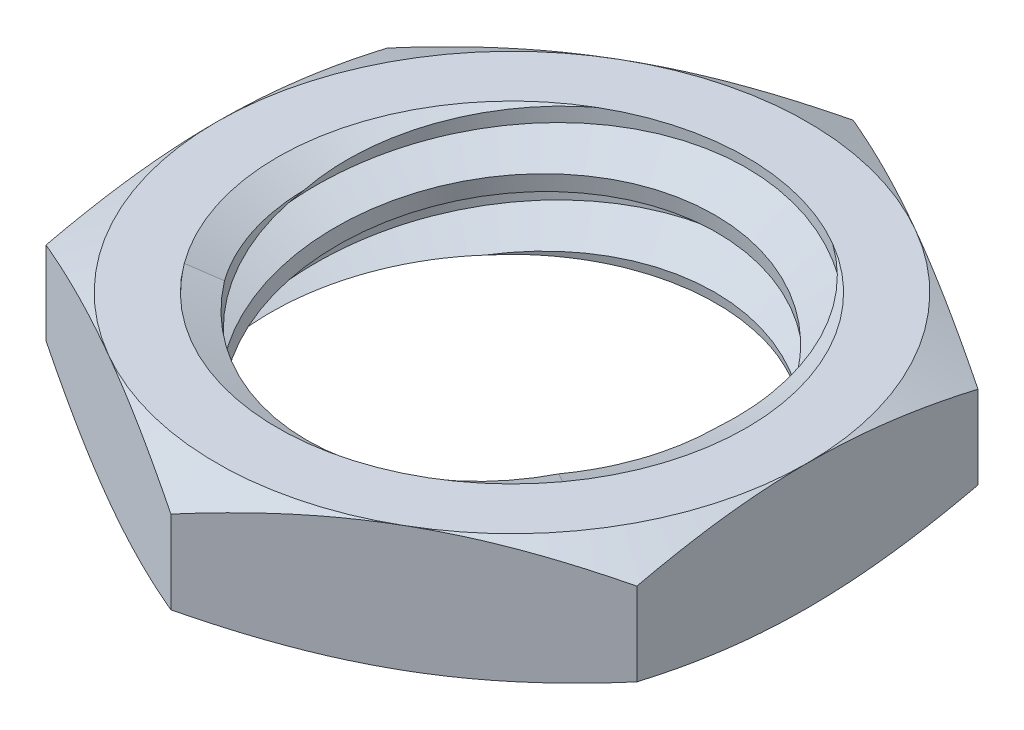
ISO-10303-21;
HEADER;
FILE_DESCRIPTION(('STEP AP214'),'2;1');
FILE_NAME('part.step','',(''),(''),'','','');
FILE_SCHEMA(('AUTOMOTIVE_DESIGN { 1 0 10303 214 1 1 1 1 }'));
ENDSEC;
DATA;
#1=APPLICATION_CONTEXT('core data for automotive mechanical design processes');
#2=APPLICATION_PROTOCOL_DEFINITION('international standard','automotive_design',2000,#1);
#3=PRODUCT_CONTEXT('',#1,'mechanical');
#4=PRODUCT('Part','Part','',(#3));
#5=PRODUCT_RELATED_PRODUCT_CATEGORY('part','',(#4));
#6=PRODUCT_DEFINITION_FORMATION('','',#4);
#7=PRODUCT_DEFINITION_CONTEXT('part definition',#1,'design');
#8=PRODUCT_DEFINITION('design','',#6,#7);
#9=PRODUCT_DEFINITION_SHAPE('','',#8);
#10=(LENGTH_UNIT() NAMED_UNIT(*) SI_UNIT(.MILLI.,.METRE.));
#11=(NAMED_UNIT(*) PLANE_ANGLE_UNIT() SI_UNIT($,.RADIAN.));
#12=(NAMED_UNIT(*) SI_UNIT($,.STERADIAN.) SOLID_ANGLE_UNIT());
#13=UNCERTAINTY_MEASURE_WITH_UNIT(LENGTH_MEASURE(1.E-05),#10,'distance_accuracy_value','');
#14=(GEOMETRIC_REPRESENTATION_CONTEXT(3) GLOBAL_UNCERTAINTY_ASSIGNED_CONTEXT((#13)) GLOBAL_UNIT_ASSIGNED_CONTEXT((#10,
#11,#12)) REPRESENTATION_CONTEXT('',''));
#15=CARTESIAN_POINT('',(0.,0.,0.));
#16=DIRECTION('',(0.,0.,1.));
#17=DIRECTION('',(1.,0.,0.));
#18=AXIS2_PLACEMENT_3D('',#15,#16,#17);
#19=CARTESIAN_POINT('',(0.,1.49951381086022,0.));
#20=DIRECTION('',(0.,1.,0.));
#21=DIRECTION('',(0.,0.,1.));
#22=AXIS2_PLACEMENT_3D('',#19,#20,#21);
#23=CONICAL_SURFACE('',#22,2.74505597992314,1.13446401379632);
#24=CARTESIAN_POINT('',(0.,1.7,0.));
#25=DIRECTION('',(0.,-1.,0.));
#26=DIRECTION('',(0.,0.,-1.));
#27=AXIS2_PLACEMENT_3D('',#24,#25,#26);
#28=CIRCLE('',#27,3.175);
#29=CARTESIAN_POINT('',(-2.56029593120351,1.7,1.87763408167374));
#30=VERTEX_POINT('',#29);
#31=CARTESIAN_POINT('',(-1.5973652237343,1.7,-2.74391132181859));
#32=VERTEX_POINT('',#31);
#33=EDGE_CURVE('E391',#30,#32,#28,.T.);
#34=ORIENTED_EDGE('',*,*,#33,.F.);
#35=CARTESIAN_POINT('',(-2.56062548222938,1.7002,1.87790996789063));
#36=CARTESIAN_POINT('',(-2.50543297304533,1.66670631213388,1.83171579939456));
#37=CARTESIAN_POINT('',(-2.4502702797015,1.63321895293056,1.78548152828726));
#38=CARTESIAN_POINT('',(-2.34000452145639,1.56625688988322,1.69293277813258));
#39=CARTESIAN_POINT('',(-2.28490145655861,1.53278218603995,1.64661829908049));
#40=CARTESIAN_POINT('',(-2.22982820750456,1.49931381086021,1.60026371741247));
#41=B_SPLINE_CURVE_WITH_KNOTS('',3,(#35,#36,#37,#38,#39,#40),.UNSPECIFIED.,.F.,.F.,(4,2,4),(0.,
0.238154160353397,0.476308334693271),.UNSPECIFIED.);
#42=CARTESIAN_POINT('',(-2.26382124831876,1.51997106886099,1.62887248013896));
#43=VERTEX_POINT('',#42);
#44=EDGE_CURVE('E11',#30,#43,#41,.T.);
#45=ORIENTED_EDGE('',*,*,#44,.T.);
#46=CARTESIAN_POINT('',(-0.363572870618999,1.52561232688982,2.77732832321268));
#47=CARTESIAN_POINT('',(-0.440691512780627,1.52553996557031,2.7670838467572));
#48=CARTESIAN_POINT('',(-0.517370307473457,1.52544453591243,2.75356353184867));
#49=CARTESIAN_POINT('',(-0.669309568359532,1.52521259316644,2.72011052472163));
#50=CARTESIAN_POINT('',(-0.744570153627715,1.52507608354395,2.70017837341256));
#51=CARTESIAN_POINT('',(-0.893068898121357,1.52476718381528,2.65406364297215));
#52=CARTESIAN_POINT('',(-0.966309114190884,1.5245948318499,2.62788770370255));
#53=CARTESIAN_POINT('',(-1.11031502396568,1.52422120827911,2.56949027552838));
#54=CARTESIAN_POINT('',(-1.18108072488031,1.52401993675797,2.5372688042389));
#55=CARTESIAN_POINT('',(-1.38906307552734,1.52338399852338,2.43179282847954));
#56=CARTESIAN_POINT('',(-1.52194531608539,1.52291725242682,2.34973289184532));
#57=CARTESIAN_POINT('',(-1.77211337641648,1.52197333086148,2.16470204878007));
#58=CARTESIAN_POINT('',(-1.88940037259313,1.52149615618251,2.06173272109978));
#59=CARTESIAN_POINT('',(-2.10628277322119,1.52060591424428,1.83681330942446));
#60=CARTESIAN_POINT('',(-2.20571405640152,1.5201934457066,1.71470473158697));
#61=CARTESIAN_POINT('',(-2.38292339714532,1.51951188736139,1.45565647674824));
#62=CARTESIAN_POINT('',(-2.46069729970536,1.51924282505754,1.31871396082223));
#63=CARTESIAN_POINT('',(-2.59319527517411,1.51890487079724,1.03239357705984));
#64=CARTESIAN_POINT('',(-2.64767583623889,1.5188380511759,0.882902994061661));
#65=CARTESIAN_POINT('',(-2.73096475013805,1.51894720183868,0.576924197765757));
#66=CARTESIAN_POINT('',(-2.75977123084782,1.51912318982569,0.420435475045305));
#67=CARTESIAN_POINT('',(-2.79105415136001,1.51972922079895,0.103705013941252));
#68=CARTESIAN_POINT('',(-2.79333664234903,1.52016111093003,-0.056555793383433));
#69=CARTESIAN_POINT('',(-2.77096913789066,1.52126103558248,-0.375146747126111));
#70=CARTESIAN_POINT('',(-2.74633657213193,1.52192891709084,-0.533478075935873));
#71=CARTESIAN_POINT('',(-2.68570579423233,1.52315414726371,-0.782714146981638));
#72=CARTESIAN_POINT('',(-2.65795688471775,1.52365207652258,-0.875703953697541));
#73=CARTESIAN_POINT('',(-2.59313858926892,1.52470214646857,-1.05820840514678));
#74=CARTESIAN_POINT('',(-2.55608414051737,1.52525419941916,-1.14772835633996));
#75=CARTESIAN_POINT('',(-2.51450231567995,1.52582645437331,-1.23514720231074));
#76=B_SPLINE_CURVE_WITH_KNOTS('',3,(#46,#47,#48,#49,#50,#51,#52,#53,#54,#55,#56,#57,#58,#59,#60,
#61,#62,#63,#64,#65,#66,#67,#68,#69,#70,#71,#72,#73,#74,#75),.UNSPECIFIED.,.F.,.F.,(4,2,2,2,2,2,
2,2,2,2,2,2,2,2,4),(0.,0.233311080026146,0.466602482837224,0.699646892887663,0.932690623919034,
1.39883908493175,1.86495236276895,2.33515215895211,2.80544210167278,3.2805349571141,
3.75566245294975,4.23426201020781,4.71255181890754,5.00321437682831,5.29341331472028),.UNSPECIFIED.);
#77=CARTESIAN_POINT('',(-2.78881235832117,1.51997106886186,0.0252553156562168));
#78=VERTEX_POINT('',#77);
#79=EDGE_CURVE('E532',#43,#78,#76,.T.);
#80=ORIENTED_EDGE('',*,*,#79,.T.);
#81=CARTESIAN_POINT('',(-0.36089293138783,1.36386020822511,2.42746541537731));
#82=CARTESIAN_POINT('',(-0.438989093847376,1.36452141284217,2.41728834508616));
#83=CARTESIAN_POINT('',(-0.516615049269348,1.36539697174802,2.40381200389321));
#84=CARTESIAN_POINT('',(-0.670442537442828,1.36756984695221,2.37036802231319));
#85=CARTESIAN_POINT('',(-0.746644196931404,1.36886712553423,2.35040096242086));
#86=CARTESIAN_POINT('',(-0.97207961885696,1.37337479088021,2.28102189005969));
#87=CARTESIAN_POINT('',(-1.11848843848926,1.37720395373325,2.22208663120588));
#88=CARTESIAN_POINT('',(-1.40027674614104,1.38642745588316,2.0801303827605));
#89=CARTESIAN_POINT('',(-1.53557061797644,1.39183270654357,1.99694148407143));
#90=CARTESIAN_POINT('',(-1.79033022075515,1.40403964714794,1.80907856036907));
#91=CARTESIAN_POINT('',(-1.90979085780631,1.41084178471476,1.7043976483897));
#92=CARTESIAN_POINT('',(-2.12974992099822,1.42565451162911,1.47644727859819));
#93=CARTESIAN_POINT('',(-2.23021236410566,1.43366734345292,1.35314332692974));
#94=CARTESIAN_POINT('',(-2.40913383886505,1.45065648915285,1.09171960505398));
#95=CARTESIAN_POINT('',(-2.48762249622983,1.45963148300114,0.953620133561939));
#96=CARTESIAN_POINT('',(-2.58898861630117,1.47384612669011,0.734906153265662));
#97=CARTESIAN_POINT('',(-2.62056098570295,1.47883220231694,0.65818928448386));
#98=CARTESIAN_POINT('',(-2.67694590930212,1.48896258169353,0.5023241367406));
#99=CARTESIAN_POINT('',(-2.70175867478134,1.49410688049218,0.423175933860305));
#100=CARTESIAN_POINT('',(-2.76473731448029,1.50947128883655,0.186789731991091));
#101=CARTESIAN_POINT('',(-2.79316938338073,1.51986710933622,0.0268527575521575));
#102=CARTESIAN_POINT('',(-2.82276803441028,1.54083255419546,-0.295683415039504));
#103=CARTESIAN_POINT('',(-2.82389210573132,1.55140242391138,-0.458286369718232));
#104=CARTESIAN_POINT('',(-2.79878020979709,1.57240122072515,-0.781313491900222));
#105=CARTESIAN_POINT('',(-2.77255796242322,1.58283021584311,-0.941738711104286));
#106=CARTESIAN_POINT('',(-2.69345547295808,1.60325343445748,-1.25589217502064));
#107=CARTESIAN_POINT('',(-2.64057791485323,1.61324770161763,-1.40962109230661));
#108=CARTESIAN_POINT('',(-2.50965964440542,1.63250516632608,-1.70582652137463));
#109=CARTESIAN_POINT('',(-2.43164273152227,1.64176904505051,-1.8483135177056));
#110=CARTESIAN_POINT('',(-2.25258049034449,1.65929903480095,-2.11793540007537));
#111=CARTESIAN_POINT('',(-2.15156072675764,1.66756623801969,-2.24508709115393));
#112=CARTESIAN_POINT('',(-1.97286186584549,1.67986855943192,-2.43429683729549));
#113=CARTESIAN_POINT('',(-1.90147627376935,1.68429549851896,-2.50238240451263));
#114=CARTESIAN_POINT('',(-1.75202408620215,1.69263993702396,-2.63071731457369));
#115=CARTESIAN_POINT('',(-1.6739622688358,1.6965577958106,-2.69097218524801));
#116=CARTESIAN_POINT('',(-1.47987535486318,1.70528099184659,-2.82512996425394));
#117=CARTESIAN_POINT('',(-1.36103511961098,1.70982552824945,-2.89502149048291));
#118=CARTESIAN_POINT('',(-1.11403047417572,1.71775221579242,-3.01692703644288));
#119=CARTESIAN_POINT('',(-0.985838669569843,1.72113077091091,-3.06888574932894));
#120=CARTESIAN_POINT('',(-0.854475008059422,1.72386723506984,-3.11096964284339));
#121=B_SPLINE_CURVE_WITH_KNOTS('',3,(#81,#82,#83,#84,#85,#86,#87,#88,#89,#90,#91,#92,#93,#94,
#95,#96,#97,#98,#99,#100,#101,#102,#103,#104,#105,#106,#107,#108,#109,#110,#111,#112,#113,#114,
#115,#116,#117,#118,#119,#120),.UNSPECIFIED.,.F.,.F.,(4,2,2,2,2,2,2,2,2,2,2,2,2,2,2,2,2,2,2,4),
(0.,0.236131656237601,0.472242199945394,0.943433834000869,1.41796832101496,1.89265510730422,
2.36823214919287,2.84316488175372,3.0922194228,3.34126617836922,3.82709693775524,
4.31368394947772,4.80002695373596,5.28632099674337,5.77215601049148,6.25745369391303,
6.55321200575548,6.84876038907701,7.26105987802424,7.67461981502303),.UNSPECIFIED.);
#122=EDGE_CURVE('E524',#78,#32,#121,.T.);
#123=ORIENTED_EDGE('',*,*,#122,.T.);
#124=EDGE_LOOP('',(#34,#45,#80,#123));
#125=FACE_BOUND('',#124,.T.);
#126=ADVANCED_FACE('F36',(#125),#23,.F.);
#127=CARTESIAN_POINT('',(0.,0.,0.));
#128=DIRECTION('',(0.,-1.,0.));
#129=DIRECTION('',(0.,0.,-1.));
#130=AXIS2_PLACEMENT_3D('',#127,#128,#129);
#131=CONICAL_SURFACE('',#130,3.175,1.13446401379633);
#132=CARTESIAN_POINT('',(0.,0.,0.));
#133=DIRECTION('',(0.,-1.,0.));
#134=DIRECTION('',(0.,0.,-1.));
#135=AXIS2_PLACEMENT_3D('',#132,#133,#134);
#136=CIRCLE('',#135,3.175);
#137=CARTESIAN_POINT('',(1.97301012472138,0.,2.48754016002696));
#138=VERTEX_POINT('',#137);
#139=CARTESIAN_POINT('',(-1.97301012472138,0.,2.48754016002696));
#140=VERTEX_POINT('',#139);
#141=EDGE_CURVE('E588',#138,#140,#136,.T.);
#142=ORIENTED_EDGE('',*,*,#141,.T.);
#143=CARTESIAN_POINT('',(-5.96328180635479,-1.30507360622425,0.353316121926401));
#144=CARTESIAN_POINT('',(-5.84124664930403,-1.25053115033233,0.435043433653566));
#145=CARTESIAN_POINT('',(-5.71861689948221,-1.19660352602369,0.516304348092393));
#146=CARTESIAN_POINT('',(-5.47194407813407,-1.09020493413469,0.677674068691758));
#147=CARTESIAN_POINT('',(-5.34790077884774,-1.03773420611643,0.757782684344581));
#148=CARTESIAN_POINT('',(-5.09773350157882,-0.934294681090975,0.916908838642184));
#149=CARTESIAN_POINT('',(-4.97160333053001,-0.883332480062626,0.995920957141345));
#150=CARTESIAN_POINT('',(-4.71749130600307,-0.783421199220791,1.15220888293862));
#151=CARTESIAN_POINT('',(-4.58950954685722,-0.73447201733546,1.22948477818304));
#152=CARTESIAN_POINT('',(-4.33077281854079,-0.638695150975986,1.38226693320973));
#153=CARTESIAN_POINT('',(-4.2000074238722,-0.591878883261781,1.45776281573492));
#154=CARTESIAN_POINT('',(-3.93599284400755,-0.50103097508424,1.60603166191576));
#155=CARTESIAN_POINT('',(-3.80274344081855,-0.456999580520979,1.67880438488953));
#156=CARTESIAN_POINT('',(-3.39914863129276,-0.329904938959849,1.89182354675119));
#157=CARTESIAN_POINT('',(-3.12446626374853,-0.251655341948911,2.02706693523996));
#158=CARTESIAN_POINT('',(-2.77236047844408,-0.16450618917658,2.18261637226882));
#159=CARTESIAN_POINT('',(-2.70135716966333,-0.147577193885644,2.21311017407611));
#160=CARTESIAN_POINT('',(-2.55844470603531,-0.114857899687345,2.27255626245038));
#161=CARTESIAN_POINT('',(-2.48653551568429,-0.0990676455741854,2.30150848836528));
#162=CARTESIAN_POINT('',(-2.26936049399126,-0.0534935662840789,2.38581395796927));
#163=CARTESIAN_POINT('',(-2.12269142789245,-0.0255174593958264,2.43859622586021));
#164=CARTESIAN_POINT('',(-1.84223613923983,0.0222942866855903,2.53030181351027));
#165=CARTESIAN_POINT('',(-1.70883712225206,0.0426898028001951,2.57011422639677));
#166=CARTESIAN_POINT('',(-1.43931833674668,0.0790016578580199,2.64193198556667));
#167=CARTESIAN_POINT('',(-1.30319836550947,0.0949176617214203,2.67393674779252));
#168=CARTESIAN_POINT('',(-1.0287384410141,0.122040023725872,2.72903930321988));
#169=CARTESIAN_POINT('',(-0.890399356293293,0.133248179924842,2.7521404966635));
#170=CARTESIAN_POINT('',(-0.612124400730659,0.150813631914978,2.78857448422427));
#171=CARTESIAN_POINT('',(-0.472188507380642,0.157170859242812,2.80190714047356));
#172=CARTESIAN_POINT('',(-0.167207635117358,0.165625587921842,2.81965978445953));
#173=CARTESIAN_POINT('',(-0.00201761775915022,0.166792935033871,2.82213265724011));
#174=CARTESIAN_POINT('',(0.327883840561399,0.162308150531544,2.81269310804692));
#175=CARTESIAN_POINT('',(0.492595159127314,0.156654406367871,2.80077728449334));
#176=CARTESIAN_POINT('',(0.820070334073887,0.138625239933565,2.76324798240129));
#177=CARTESIAN_POINT('',(0.982833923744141,0.126248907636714,2.73763264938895));
#178=CARTESIAN_POINT('',(1.30521582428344,0.0950039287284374,2.67407542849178));
#179=CARTESIAN_POINT('',(1.46483534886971,0.0761378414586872,2.63613840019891));
#180=CARTESIAN_POINT('',(1.68172091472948,0.0459841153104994,2.57671001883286));
#181=CARTESIAN_POINT('',(1.74064523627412,0.037323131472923,2.55974692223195));
#182=CARTESIAN_POINT('',(1.85786520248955,0.0191768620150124,2.52445534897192));
#183=CARTESIAN_POINT('',(1.9161615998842,0.0096927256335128,2.50612878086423));
#184=CARTESIAN_POINT('',(2.24779771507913,-0.0468510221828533,2.39768923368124));
#185=CARTESIAN_POINT('',(2.5153112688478,-0.102588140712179,2.29386322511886));
#186=CARTESIAN_POINT('',(2.90784772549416,-0.1974704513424,2.12353590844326));
#187=CARTESIAN_POINT('',(3.0375498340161,-0.231075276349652,2.06416240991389));
#188=CARTESIAN_POINT('',(3.29398682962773,-0.301569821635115,1.94153604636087));
#189=CARTESIAN_POINT('',(3.42072534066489,-0.338455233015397,1.87828830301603));
#190=CARTESIAN_POINT('',(3.5462464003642,-0.376796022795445,1.81349317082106));
#191=B_SPLINE_CURVE_WITH_KNOTS('',3,(#143,#144,#145,#146,#147,#148,#149,#150,#151,#152,#153,
#154,#155,#156,#157,#158,#159,#160,#161,#162,#163,#164,#165,#166,#167,#168,#169,#170,#171,#172,
#173,#174,#175,#176,#177,#178,#179,#180,#181,#182,#183,#184,#185,#186,#187,#188,#189,#190),
.UNSPECIFIED.,.F.,.F.,(4,2,2,2,2,2,2,2,2,2,2,2,2,2,2,2,2,2,2,2,2,2,2,4),(0.,0.470028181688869,
0.940133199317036,1.41205694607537,1.88395673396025,2.35814088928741,2.83236685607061,
3.77901468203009,4.01631416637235,4.25362298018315,4.72838942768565,5.15021424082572,
5.57207059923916,5.99376569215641,6.41546673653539,6.91031497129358,7.40528021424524,
7.90031247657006,8.39514973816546,8.580911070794,8.76641710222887,9.64120594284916,
10.0807971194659,10.5198192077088),.UNSPECIFIED.);
#192=EDGE_CURVE('E451',#140,#138,#191,.T.);
#193=ORIENTED_EDGE('',*,*,#192,.T.);
#194=EDGE_LOOP('',(#142,#193));
#195=FACE_BOUND('',#194,.T.);
#196=ADVANCED_FACE('F628',(#195),#131,.F.);
#197=CARTESIAN_POINT('',(4.,1.7,-2.30940107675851));
#198=DIRECTION('',(0.,-1.,0.));
#199=DIRECTION('',(0.,0.,-1.));
#200=AXIS2_PLACEMENT_3D('',#197,#198,#199);
#201=PLANE('',#200);
#202=CARTESIAN_POINT('',(1.59736522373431,1.7,-2.74391132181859));
#203=VERTEX_POINT('',#202);
#204=CARTESIAN_POINT('',(2.56029593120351,1.7,1.87763408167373));
#205=VERTEX_POINT('',#204);
#206=EDGE_CURVE('E386',#203,#205,#28,.T.);
#207=ORIENTED_EDGE('',*,*,#206,.T.);
#208=CARTESIAN_POINT('',(0.,1.7,0.));
#209=DIRECTION('',(0.,-1.,0.));
#210=DIRECTION('',(0.,0.,-1.));
#211=AXIS2_PLACEMENT_3D('',#208,#209,#210);
#212=CIRCLE('',#211,3.175);
#213=EDGE_CURVE('E559',#205,#30,#212,.T.);
#214=ORIENTED_EDGE('',*,*,#213,.T.);
#215=ORIENTED_EDGE('',*,*,#33,.T.);
#216=EDGE_CURVE('E564',#32,#203,#212,.T.);
#217=ORIENTED_EDGE('',*,*,#216,.T.);
#218=EDGE_LOOP('',(#207,#214,#215,#217));
#219=FACE_BOUND('',#218,.T.);
#220=CARTESIAN_POINT('',(0.,1.7,0.));
#221=DIRECTION('',(0.,-1.,0.));
#222=DIRECTION('',(0.,0.,-1.));
#223=AXIS2_PLACEMENT_3D('',#220,#221,#222);
#224=CIRCLE('',#223,4.);
#225=CARTESIAN_POINT('',(-2.,1.7,-3.46410161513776));
#226=VERTEX_POINT('',#225);
#227=CARTESIAN_POINT('',(2.,1.7,-3.46410161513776));
#228=VERTEX_POINT('',#227);
#229=EDGE_CURVE('E204',#226,#228,#224,.T.);
#230=ORIENTED_EDGE('',*,*,#229,.F.);
#231=CARTESIAN_POINT('',(-4.,1.7,0.));
#232=VERTEX_POINT('',#231);
#233=EDGE_CURVE('E58',#232,#226,#224,.T.);
#234=ORIENTED_EDGE('',*,*,#233,.F.);
#235=CARTESIAN_POINT('',(-2.,1.7,3.46410161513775));
#236=VERTEX_POINT('',#235);
#237=EDGE_CURVE('E621',#236,#232,#224,.T.);
#238=ORIENTED_EDGE('',*,*,#237,.F.);
#239=CARTESIAN_POINT('',(2.,1.7,3.46410161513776));
#240=VERTEX_POINT('',#239);
#241=EDGE_CURVE('E616',#240,#236,#224,.T.);
#242=ORIENTED_EDGE('',*,*,#241,.F.);
#243=CARTESIAN_POINT('',(4.,1.7,0.));
#244=VERTEX_POINT('',#243);
#245=EDGE_CURVE('E214',#244,#240,#224,.T.);
#246=ORIENTED_EDGE('',*,*,#245,.F.);
#247=EDGE_CURVE('E191',#228,#244,#224,.T.);
#248=ORIENTED_EDGE('',*,*,#247,.F.);
#249=EDGE_LOOP('',(#230,#234,#238,#242,#246,#248));
#250=FACE_BOUND('',#249,.T.);
#251=ADVANCED_FACE('F211',(#219,#250),#201,.F.);
#252=CARTESIAN_POINT('',(4.,0.,-2.30940107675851));
#253=DIRECTION('',(0.,-1.,0.));
#254=DIRECTION('',(0.,0.,-1.));
#255=AXIS2_PLACEMENT_3D('',#252,#253,#254);
#256=PLANE('',#255);
#257=CARTESIAN_POINT('',(0.,0.,0.));
#258=DIRECTION('',(0.,-1.,0.));
#259=DIRECTION('',(0.,0.,-1.));
#260=AXIS2_PLACEMENT_3D('',#257,#258,#259);
#261=CIRCLE('',#260,4.);
#262=CARTESIAN_POINT('',(-4.,0.,0.));
#263=VERTEX_POINT('',#262);
#264=CARTESIAN_POINT('',(-2.,0.,-3.46410161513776));
#265=VERTEX_POINT('',#264);
#266=EDGE_CURVE('E318',#263,#265,#261,.T.);
#267=ORIENTED_EDGE('',*,*,#266,.T.);
#268=CARTESIAN_POINT('',(2.,0.,-3.46410161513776));
#269=VERTEX_POINT('',#268);
#270=EDGE_CURVE('E215',#265,#269,#261,.T.);
#271=ORIENTED_EDGE('',*,*,#270,.T.);
#272=CARTESIAN_POINT('',(4.,0.,0.));
#273=VERTEX_POINT('',#272);
#274=EDGE_CURVE('E320',#269,#273,#261,.T.);
#275=ORIENTED_EDGE('',*,*,#274,.T.);
#276=CARTESIAN_POINT('',(2.,0.,3.46410161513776));
#277=VERTEX_POINT('',#276);
#278=EDGE_CURVE('E331',#273,#277,#261,.T.);
#279=ORIENTED_EDGE('',*,*,#278,.T.);
#280=CARTESIAN_POINT('',(-2.,0.,3.46410161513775));
#281=VERTEX_POINT('',#280);
#282=EDGE_CURVE('E328',#277,#281,#261,.T.);
#283=ORIENTED_EDGE('',*,*,#282,.T.);
#284=EDGE_CURVE('E325',#281,#263,#261,.T.);
#285=ORIENTED_EDGE('',*,*,#284,.T.);
#286=EDGE_LOOP('',(#267,#271,#275,#279,#283,#285));
#287=FACE_BOUND('',#286,.T.);
#288=CARTESIAN_POINT('',(0.,0.,0.));
#289=DIRECTION('',(0.,-1.,0.));
#290=DIRECTION('',(0.,0.,-1.));
#291=AXIS2_PLACEMENT_3D('',#288,#289,#290);
#292=CIRCLE('',#291,3.175);
#293=CARTESIAN_POINT('',(2.98049152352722,0.,1.09420988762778));
#294=VERTEX_POINT('',#293);
#295=EDGE_CURVE('E571',#294,#138,#292,.T.);
#296=ORIENTED_EDGE('',*,*,#295,.F.);
#297=CARTESIAN_POINT('',(-2.98049152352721,0.,1.09420988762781));
#298=VERTEX_POINT('',#297);
#299=EDGE_CURVE('E590',#298,#294,#136,.T.);
#300=ORIENTED_EDGE('',*,*,#299,.F.);
#301=EDGE_CURVE('E483',#140,#298,#292,.T.);
#302=ORIENTED_EDGE('',*,*,#301,.F.);
#303=ORIENTED_EDGE('',*,*,#141,.F.);
#304=EDGE_LOOP('',(#296,#300,#302,#303));
#305=FACE_BOUND('',#304,.T.);
#306=ADVANCED_FACE('F322',(#287,#305),#256,.T.);
#307=CARTESIAN_POINT('',(2.51450231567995,1.52582645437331,-1.23514720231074));
#308=CARTESIAN_POINT('',(2.54872833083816,1.52535551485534,-1.16319692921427));
#309=CARTESIAN_POINT('',(2.57989520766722,1.52489803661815,-1.08979689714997));
#310=CARTESIAN_POINT('',(2.63593222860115,1.52401849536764,-0.940637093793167));
#311=CARTESIAN_POINT('',(2.66080284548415,1.52359642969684,-0.864877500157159));
#312=CARTESIAN_POINT('',(2.70405767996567,1.52279643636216,-0.711585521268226));
#313=CARTESIAN_POINT('',(2.72244680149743,1.52241847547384,-0.634054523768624));
#314=CARTESIAN_POINT('',(2.75264805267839,1.52171324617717,-0.477743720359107));
#315=CARTESIAN_POINT('',(2.7644602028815,1.52138597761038,-0.39896391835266));
#316=CARTESIAN_POINT('',(2.78990332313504,1.52048863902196,-0.161423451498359));
#317=CARTESIAN_POINT('',(2.79353877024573,1.52000307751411,-0.00146952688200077));
#318=CARTESIAN_POINT('',(2.77399640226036,1.51928515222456,0.316682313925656));
#319=CARTESIAN_POINT('',(2.75082246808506,1.51905275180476,0.474880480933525));
#320=CARTESIAN_POINT('',(2.67819968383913,1.51883711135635,0.785710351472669));
#321=CARTESIAN_POINT('',(2.62866352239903,1.51885470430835,0.93832174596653));
#322=CARTESIAN_POINT('',(2.50459270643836,1.51910944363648,1.2330434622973));
#323=CARTESIAN_POINT('',(2.43005476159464,1.51934661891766,1.37515239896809));
#324=CARTESIAN_POINT('',(2.25829262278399,1.51998210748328,1.64431355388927));
#325=CARTESIAN_POINT('',(2.16113913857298,1.52037992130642,1.77141087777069));
#326=CARTESIAN_POINT('',(1.94669329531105,1.52126128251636,2.00732202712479));
#327=CARTESIAN_POINT('',(1.82940062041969,1.52174483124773,2.11613556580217));
#328=CARTESIAN_POINT('',(1.57904735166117,1.52270940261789,2.31138873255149));
#329=CARTESIAN_POINT('',(1.44612426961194,1.52319041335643,2.39800489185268));
#330=CARTESIAN_POINT('',(1.16753700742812,1.52407398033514,2.54736103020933));
#331=CARTESIAN_POINT('',(1.02188386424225,1.52447660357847,2.61012144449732));
#332=CARTESIAN_POINT('',(0.789340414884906,1.52499015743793,2.68753360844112));
#333=CARTESIAN_POINT('',(0.705330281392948,1.525150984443,2.71114485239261));
#334=CARTESIAN_POINT('',(0.53559808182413,1.52542154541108,2.75030014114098));
#335=CARTESIAN_POINT('',(0.449879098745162,1.52553136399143,2.76585755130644));
#336=CARTESIAN_POINT('',(0.363572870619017,1.52561232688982,2.77732832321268));
#337=B_SPLINE_CURVE_WITH_KNOTS('',3,(#307,#308,#309,#310,#311,#312,#313,#314,#315,#316,#317,
#318,#319,#320,#321,#322,#323,#324,#325,#326,#327,#328,#329,#330,#331,#332,#333,#334,#335,#336),
.UNSPECIFIED.,.F.,.F.,(4,2,2,2,2,2,2,2,2,2,2,2,2,2,4),(0.,0.238952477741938,0.477887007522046,
0.716640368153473,0.95539298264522,1.43292221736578,1.9103823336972,2.38943372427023,
2.86854818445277,3.34618430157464,3.82382791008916,4.29754598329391,4.77085734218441,
5.03230509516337,5.29331757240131),.UNSPECIFIED.);
#338=CARTESIAN_POINT('',(2.78881235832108,1.51997106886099,0.0252553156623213));
#339=VERTEX_POINT('',#338);
#340=CARTESIAN_POINT('',(2.26382124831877,1.51997106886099,1.62887248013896));
#341=VERTEX_POINT('',#340);
#342=EDGE_CURVE('E547',#339,#341,#337,.T.);
#343=ORIENTED_EDGE('',*,*,#342,.T.);
#344=CARTESIAN_POINT('',(2.22982820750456,1.49931381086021,1.60026371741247));
#345=CARTESIAN_POINT('',(2.28490145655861,1.53278218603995,1.64661829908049));
#346=CARTESIAN_POINT('',(2.34000452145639,1.56625688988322,1.69293277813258));
#347=CARTESIAN_POINT('',(2.4502702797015,1.63321895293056,1.78548152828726));
#348=CARTESIAN_POINT('',(2.50543297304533,1.66670631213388,1.83171579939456));
#349=CARTESIAN_POINT('',(2.56062548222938,1.7002,1.87790996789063));
#350=B_SPLINE_CURVE_WITH_KNOTS('',3,(#344,#345,#346,#347,#348,#349),.UNSPECIFIED.,.F.,.F.,(4,2,
4),(0.,0.238154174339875,0.476308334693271),.UNSPECIFIED.);
#351=EDGE_CURVE('E51',#341,#205,#350,.T.);
#352=ORIENTED_EDGE('',*,*,#351,.T.);
#353=ORIENTED_EDGE('',*,*,#206,.F.);
#354=CARTESIAN_POINT('',(0.854475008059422,1.72386723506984,-3.11096964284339));
#355=CARTESIAN_POINT('',(0.98572313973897,1.7211322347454,-3.06890826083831));
#356=CARTESIAN_POINT('',(1.11376366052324,1.71775885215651,-3.01702909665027));
#357=CARTESIAN_POINT('',(1.36075936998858,1.7098362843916,-2.89518691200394));
#358=CARTESIAN_POINT('',(1.47972229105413,1.70528811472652,-2.82523951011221));
#359=CARTESIAN_POINT('',(1.70873041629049,1.69499489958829,-2.66693573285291));
#360=CARTESIAN_POINT('',(1.81850769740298,1.68922473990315,-2.57819307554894));
#361=CARTESIAN_POINT('',(2.02364958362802,1.67668987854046,-2.38540914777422));
#362=CARTESIAN_POINT('',(2.1190098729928,1.66992488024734,-2.28136331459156));
#363=CARTESIAN_POINT('',(2.30457783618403,1.6546203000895,-2.04597422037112));
#364=CARTESIAN_POINT('',(2.39251693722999,1.64596435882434,-1.9128407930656));
#365=CARTESIAN_POINT('',(2.545058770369,1.62782235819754,-1.63379945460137));
#366=CARTESIAN_POINT('',(2.60964840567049,1.61833583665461,-1.48788443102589));
#367=CARTESIAN_POINT('',(2.71433490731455,1.59869508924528,-1.18577583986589));
#368=CARTESIAN_POINT('',(2.75415766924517,1.58853472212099,-1.02948772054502));
#369=CARTESIAN_POINT('',(2.80712015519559,1.56793243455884,-0.712570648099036));
#370=CARTESIAN_POINT('',(2.82028113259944,1.55749074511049,-0.551945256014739));
#371=CARTESIAN_POINT('',(2.81973863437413,1.53900564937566,-0.267577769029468));
#372=CARTESIAN_POINT('',(2.8114881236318,1.53095960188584,-0.14379726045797));
#373=CARTESIAN_POINT('',(2.77911795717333,1.51500316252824,0.101683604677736));
#374=CARTESIAN_POINT('',(2.75499786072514,1.50709277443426,0.223383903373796));
#375=CARTESIAN_POINT('',(2.68160887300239,1.489194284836,0.498757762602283));
#376=CARTESIAN_POINT('',(2.6269567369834,1.4792971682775,0.65103391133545));
#377=CARTESIAN_POINT('',(2.49275481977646,1.46023480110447,0.944336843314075));
#378=CARTESIAN_POINT('',(2.41318727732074,1.45107007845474,1.0853555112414));
#379=CARTESIAN_POINT('',(2.23141869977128,1.43375398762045,1.35180998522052));
#380=CARTESIAN_POINT('',(2.12924409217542,1.42560145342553,1.47726372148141));
#381=CARTESIAN_POINT('',(1.90501983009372,1.41053990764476,1.70904324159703));
#382=CARTESIAN_POINT('',(1.78297041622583,1.40363088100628,1.81536925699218));
#383=CARTESIAN_POINT('',(1.52382930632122,1.39133025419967,2.00467431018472));
#384=CARTESIAN_POINT('',(1.38690544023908,1.38592376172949,2.08788247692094));
#385=CARTESIAN_POINT('',(1.10093541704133,1.37670258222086,2.22980322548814));
#386=CARTESIAN_POINT('',(0.951902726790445,1.37288615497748,2.28854258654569));
#387=CARTESIAN_POINT('',(0.727396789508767,1.36853249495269,2.35555142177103));
#388=CARTESIAN_POINT('',(0.654855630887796,1.36732982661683,2.37406230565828));
#389=CARTESIAN_POINT('',(0.508647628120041,1.36530770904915,2.40518590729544));
#390=CARTESIAN_POINT('',(0.434982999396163,1.36448758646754,2.41780898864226));
#391=CARTESIAN_POINT('',(0.360892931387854,1.36386020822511,2.42746541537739));
#392=B_SPLINE_CURVE_WITH_KNOTS('',3,(#354,#355,#356,#357,#358,#359,#360,#361,#362,#363,#364,
#365,#366,#367,#368,#369,#370,#371,#372,#373,#374,#375,#376,#377,#378,#379,#380,#381,#382,#383,
#384,#385,#386,#387,#388,#389,#390,#391),.UNSPECIFIED.,.F.,.F.,(4,2,2,2,2,2,2,2,2,2,2,2,2,2,2,2,
2,2,4),(0.,0.413107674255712,0.825859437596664,1.24810116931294,1.67046905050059,
2.14756318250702,2.62492450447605,3.10747909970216,3.58964887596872,3.96160581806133,
4.3335730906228,4.81745920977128,5.30169106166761,5.78535981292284,6.26902270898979,
6.74770535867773,7.225862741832,7.45028377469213,7.67430828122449),.UNSPECIFIED.);
#393=EDGE_CURVE('E531',#203,#339,#392,.T.);
#394=ORIENTED_EDGE('',*,*,#393,.T.);
#395=EDGE_LOOP('',(#343,#352,#353,#394));
#396=FACE_BOUND('',#395,.T.);
#397=ADVANCED_FACE('F541',(#396),#23,.F.);
#398=CARTESIAN_POINT('',(2.74791873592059,0.183476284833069,-0.431130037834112));
#399=CARTESIAN_POINT('',(2.73439428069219,0.184032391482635,-0.509687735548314));
#400=CARTESIAN_POINT('',(2.7175471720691,0.184555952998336,-0.587670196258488));
#401=CARTESIAN_POINT('',(2.67735418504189,0.185537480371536,-0.74194081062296));
#402=CARTESIAN_POINT('',(2.65400843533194,0.185995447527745,-0.818228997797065));
#403=CARTESIAN_POINT('',(2.60097419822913,0.1868451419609,-0.968541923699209));
#404=CARTESIAN_POINT('',(2.5712881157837,0.187236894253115,-1.04256750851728));
#405=CARTESIAN_POINT('',(2.50579151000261,0.187955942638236,-1.18783230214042));
#406=CARTESIAN_POINT('',(2.46998110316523,0.188283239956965,-1.2590715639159));
#407=CARTESIAN_POINT('',(2.35369747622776,0.189172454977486,-1.46783623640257));
#408=CARTESIAN_POINT('',(2.2643228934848,0.18964245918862,-1.60054700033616));
#409=CARTESIAN_POINT('',(2.06448306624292,0.190374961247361,-1.84883230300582));
#410=CARTESIAN_POINT('',(1.95402421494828,0.190637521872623,-1.96441201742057));
#411=CARTESIAN_POINT('',(1.71590701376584,0.191009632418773,-2.17439305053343));
#412=CARTESIAN_POINT('',(1.58837647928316,0.191120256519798,-2.2689390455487));
#413=CARTESIAN_POINT('',(1.31910895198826,0.191250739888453,-2.43504425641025));
#414=CARTESIAN_POINT('',(1.17737039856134,0.19127058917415,-2.50660094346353));
#415=CARTESIAN_POINT('',(0.885192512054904,0.191273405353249,-2.6239608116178));
#416=CARTESIAN_POINT('',(0.734850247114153,0.191256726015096,-2.67000565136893));
#417=CARTESIAN_POINT('',(0.428553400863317,0.191225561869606,-2.73598942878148));
#418=CARTESIAN_POINT('',(0.272599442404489,0.191211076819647,-2.75593125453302));
#419=CARTESIAN_POINT('',(-0.0392893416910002,0.19120202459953,-2.76905738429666));
#420=CARTESIAN_POINT('',(-0.195216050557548,0.191207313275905,-2.76243531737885));
#421=CARTESIAN_POINT('',(-0.503737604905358,0.191231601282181,-2.72307134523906));
#422=CARTESIAN_POINT('',(-0.656332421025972,0.191250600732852,-2.69032920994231));
#423=CARTESIAN_POINT('',(-0.953693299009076,0.191274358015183,-2.59976493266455));
#424=CARTESIAN_POINT('',(-1.09846806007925,0.191279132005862,-2.54197133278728));
#425=CARTESIAN_POINT('',(-1.37632672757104,0.191229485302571,-2.4030319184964));
#426=CARTESIAN_POINT('',(-1.50941107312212,0.191175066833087,-2.32188698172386));
#427=CARTESIAN_POINT('',(-1.76092130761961,0.190952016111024,-2.13811781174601));
#428=CARTESIAN_POINT('',(-1.8792638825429,0.190782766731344,-2.03537960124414));
#429=CARTESIAN_POINT('',(-2.09725914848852,0.190273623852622,-1.81161703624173));
#430=CARTESIAN_POINT('',(-2.19690480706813,0.189933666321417,-1.69058583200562));
#431=CARTESIAN_POINT('',(-2.37566222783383,0.189032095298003,-1.4324549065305));
#432=CARTESIAN_POINT('',(-2.45456066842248,0.188468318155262,-1.29520780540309));
#433=CARTESIAN_POINT('',(-2.5883171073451,0.187088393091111,-1.00960257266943));
#434=CARTESIAN_POINT('',(-2.64321106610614,0.186272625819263,-0.861261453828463));
#435=CARTESIAN_POINT('',(-2.69815237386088,0.18504302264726,-0.663706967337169));
#436=CARTESIAN_POINT('',(-2.70975222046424,0.184745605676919,-0.617504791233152));
#437=CARTESIAN_POINT('',(-2.73059533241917,0.184128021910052,-0.524651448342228));
#438=CARTESIAN_POINT('',(-2.73984242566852,0.183807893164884,-0.47800114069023));
#439=CARTESIAN_POINT('',(-2.74791873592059,0.183476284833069,-0.431130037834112));
#440=B_SPLINE_CURVE_WITH_KNOTS('',3,(#398,#399,#400,#401,#402,#403,#404,#405,#406,#407,#408,
#409,#410,#411,#412,#413,#414,#415,#416,#417,#418,#419,#420,#421,#422,#423,#424,#425,#426,#427,
#428,#429,#430,#431,#432,#433,#434,#435,#436,#437,#438,#439),.UNSPECIFIED.,.F.,.F.,(4,2,2,2,2,2,
2,2,2,2,2,2,2,2,2,2,2,2,2,2,4),(0.,0.23906921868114,0.478133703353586,0.717107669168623,
0.956077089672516,1.43358090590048,1.91094016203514,2.38490684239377,2.8589256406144,
3.32837403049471,3.79777047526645,4.26375164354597,4.72973691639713,5.19519266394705,
5.66063092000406,6.12859056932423,6.59672588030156,7.06950134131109,7.5415661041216,
7.68443613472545,7.82707220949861),.UNSPECIFIED.);
#441=CARTESIAN_POINT('',(2.13371661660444,0.19011682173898,-1.76214779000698));
#442=VERTEX_POINT('',#441);
#443=CARTESIAN_POINT('',(-2.13371661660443,0.19011682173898,-1.76214779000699));
#444=VERTEX_POINT('',#443);
#445=EDGE_CURVE('E402',#442,#444,#440,.T.);
#446=ORIENTED_EDGE('',*,*,#445,.T.);
#447=CARTESIAN_POINT('',(-0.126257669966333,0.248773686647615,-2.63848397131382));
#448=CARTESIAN_POINT('',(-0.211225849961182,0.24853538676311,-2.63492937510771));
#449=CARTESIAN_POINT('',(-0.296001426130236,0.248056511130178,-2.62778693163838));
#450=CARTESIAN_POINT('',(-0.464641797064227,0.246622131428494,-2.606390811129));
#451=CARTESIAN_POINT('',(-0.548506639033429,0.245666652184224,-2.59213750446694));
#452=CARTESIAN_POINT('',(-0.797586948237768,0.242097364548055,-2.53888662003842));
#453=CARTESIAN_POINT('',(-0.960674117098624,0.238779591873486,-2.48938148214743));
#454=CARTESIAN_POINT('',(-1.27137932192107,0.230497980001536,-2.3657552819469));
#455=CARTESIAN_POINT('',(-1.41931538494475,0.225586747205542,-2.29242081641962));
#456=CARTESIAN_POINT('',(-1.70138084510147,0.214237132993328,-2.12285758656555));
#457=CARTESIAN_POINT('',(-1.83550990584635,0.207798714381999,-2.02662826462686));
#458=CARTESIAN_POINT('',(-2.0926582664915,0.193225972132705,-1.80868872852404));
#459=CARTESIAN_POINT('',(-2.2148139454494,0.185024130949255,-1.68596285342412));
#460=CARTESIAN_POINT('',(-2.43679732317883,0.167383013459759,-1.4218116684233));
#461=CARTESIAN_POINT('',(-2.53662102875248,0.157943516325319,-1.28038302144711));
#462=CARTESIAN_POINT('',(-2.71134402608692,0.138092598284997,-0.982753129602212));
#463=CARTESIAN_POINT('',(-2.78621660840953,0.127680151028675,-0.826536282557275));
#464=CARTESIAN_POINT('',(-2.90894941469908,0.106183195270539,-0.503795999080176));
#465=CARTESIAN_POINT('',(-2.95679779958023,0.0950983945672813,-0.337268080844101));
#466=CARTESIAN_POINT('',(-3.02458549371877,0.0724455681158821,0.00327065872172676));
#467=CARTESIAN_POINT('',(-3.04420557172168,0.0608735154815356,0.177344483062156));
#468=CARTESIAN_POINT('',(-3.05395673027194,0.0377056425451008,0.526062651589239));
#469=CARTESIAN_POINT('',(-3.04414863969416,0.0261099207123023,0.700705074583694));
#470=CARTESIAN_POINT('',(-3.00926584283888,0.00968064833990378,0.948279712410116));
#471=CARTESIAN_POINT('',(-2.99591898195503,0.00472120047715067,1.02303225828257));
#472=CARTESIAN_POINT('',(-2.94988533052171,-0.00936795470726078,1.2354427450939));
#473=CARTESIAN_POINT('',(-2.91044832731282,-0.0184031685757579,1.37171791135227));
#474=CARTESIAN_POINT('',(-2.81310551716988,-0.0360792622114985,1.63841943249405));
#475=CARTESIAN_POINT('',(-2.75509487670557,-0.0447175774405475,1.76880767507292));
#476=CARTESIAN_POINT('',(-2.68827866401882,-0.0530395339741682,1.89446367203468));
#477=B_SPLINE_CURVE_WITH_KNOTS('',3,(#447,#448,#449,#450,#451,#452,#453,#454,#455,#456,#457,
#458,#459,#460,#461,#462,#463,#464,#465,#466,#467,#468,#469,#470,#471,#472,#473,#474,#475,#476),
.UNSPECIFIED.,.F.,.F.,(4,2,2,2,2,2,2,2,2,2,2,2,2,2,4),(0.,0.254969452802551,0.509925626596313,
1.01869391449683,1.51213343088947,2.00558496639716,2.52315860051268,3.04082470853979,
3.55904319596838,4.07748853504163,4.60175204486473,5.12493263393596,5.35308786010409,
5.77812983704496,6.20561443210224),.UNSPECIFIED.);
#478=EDGE_CURVE('E444',#444,#298,#477,.T.);
#479=ORIENTED_EDGE('',*,*,#478,.T.);
#480=ORIENTED_EDGE('',*,*,#299,.T.);
#481=CARTESIAN_POINT('',(2.68827866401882,-0.0530395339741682,1.89446367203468));
#482=CARTESIAN_POINT('',(2.75488771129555,-0.044738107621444,1.76911797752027));
#483=CARTESIAN_POINT('',(2.81273586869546,-0.036131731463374,1.63921155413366));
#484=CARTESIAN_POINT('',(2.91018848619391,-0.0184648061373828,1.37264747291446));
#485=CARTESIAN_POINT('',(2.94977989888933,-0.00940393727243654,1.23598506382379));
#486=CARTESIAN_POINT('',(3.01692685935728,0.0111554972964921,0.926027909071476));
#487=CARTESIAN_POINT('',(3.0395053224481,0.0227287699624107,0.751637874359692));
#488=CARTESIAN_POINT('',(3.05501435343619,0.0459745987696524,0.401568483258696));
#489=CARTESIAN_POINT('',(3.04794200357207,0.0576471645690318,0.225889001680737));
#490=CARTESIAN_POINT('',(3.00434670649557,0.0807601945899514,-0.121756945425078));
#491=CARTESIAN_POINT('',(2.96783114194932,0.092200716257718,-0.293724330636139));
#492=CARTESIAN_POINT('',(2.86628033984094,0.114532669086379,-0.629185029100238));
#493=CARTESIAN_POINT('',(2.80122814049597,0.125423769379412,-0.792673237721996));
#494=CARTESIAN_POINT('',(2.64451513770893,0.146313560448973,-1.1060469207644));
#495=CARTESIAN_POINT('',(2.5528985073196,0.156313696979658,-1.25595443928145));
#496=CARTESIAN_POINT('',(2.34564448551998,0.175127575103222,-1.53780659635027));
#497=CARTESIAN_POINT('',(2.2300695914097,0.18394430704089,-1.66979652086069));
#498=CARTESIAN_POINT('',(2.05790280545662,0.195018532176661,-1.8354881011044));
#499=CARTESIAN_POINT('',(2.01013370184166,0.197903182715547,-1.87863782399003));
#500=CARTESIAN_POINT('',(1.83072027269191,0.208068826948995,-2.03066768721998));
#501=CARTESIAN_POINT('',(1.69093689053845,0.214736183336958,-2.13031626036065));
#502=CARTESIAN_POINT('',(1.3962558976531,0.226426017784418,-2.30495628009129));
#503=CARTESIAN_POINT('',(1.24131494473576,0.231443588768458,-2.37987417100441));
#504=CARTESIAN_POINT('',(0.92852843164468,0.239462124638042,-2.49956645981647));
#505=CARTESIAN_POINT('',(0.771174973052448,0.242547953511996,-2.54560956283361));
#506=CARTESIAN_POINT('',(0.531403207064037,0.245868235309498,-2.59514466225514));
#507=CARTESIAN_POINT('',(0.450898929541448,0.246756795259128,-2.60839959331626));
#508=CARTESIAN_POINT('',(0.28907401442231,0.24809525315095,-2.62836478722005));
#509=CARTESIAN_POINT('',(0.207753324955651,0.248545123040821,-2.63507463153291));
#510=CARTESIAN_POINT('',(0.126257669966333,0.248773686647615,-2.63848397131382));
#511=B_SPLINE_CURVE_WITH_KNOTS('',3,(#481,#482,#483,#484,#485,#486,#487,#488,#489,#490,#491,
#492,#493,#494,#495,#496,#497,#498,#499,#500,#501,#502,#503,#504,#505,#506,#507,#508,#509,#510),
.UNSPECIFIED.,.F.,.F.,(4,2,2,2,2,2,2,2,2,2,2,2,2,2,4),(0.,0.426111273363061,0.852526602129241,
1.37862298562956,1.90477114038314,2.43078740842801,2.95711675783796,3.48257586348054,
4.00668113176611,4.19993336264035,4.71258443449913,5.2267468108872,5.71635411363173,
5.96090114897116,6.20546382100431),.UNSPECIFIED.);
#512=EDGE_CURVE('E410',#294,#442,#511,.T.);
#513=ORIENTED_EDGE('',*,*,#512,.T.);
#514=EDGE_LOOP('',(#446,#479,#480,#513));
#515=FACE_BOUND('',#514,.T.);
#516=ADVANCED_FACE('F417',(#515),#131,.F.);
#517=CARTESIAN_POINT('',(0.,2.03100925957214,0.0561266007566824));
#518=DIRECTION('',(0.,0.989949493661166,0.14142135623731));
#519=DIRECTION('',(0.,-0.14142135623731,0.989949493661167));
#520=AXIS2_PLACEMENT_3D('',#517,#518,#519);
#521=CONICAL_SURFACE('',#520,3.28012973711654,1.0471975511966);
#522=CARTESIAN_POINT('',(-3.12199379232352,2.06632390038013,-0.577736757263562));
#523=CARTESIAN_POINT('',(-3.13841187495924,2.05264572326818,-0.489060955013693));
#524=CARTESIAN_POINT('',(-3.15103356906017,2.0389132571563,-0.39969509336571));
#525=CARTESIAN_POINT('',(-3.16863502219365,2.01143653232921,-0.220215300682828));
#526=CARTESIAN_POINT('',(-3.1736147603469,1.99769227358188,-0.130101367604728));
#527=CARTESIAN_POINT('',(-3.17588473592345,1.97026849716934,0.0503758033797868));
#528=CARTESIAN_POINT('',(-3.17316355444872,1.95658910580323,0.140739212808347));
#529=CARTESIAN_POINT('',(-3.16003337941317,1.92941503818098,0.320906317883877));
#530=CARTESIAN_POINT('',(-3.149624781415,1.91592035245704,0.410710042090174));
#531=CARTESIAN_POINT('',(-3.10703566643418,1.87594160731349,0.677721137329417));
#532=CARTESIAN_POINT('',(-3.06350068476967,1.84984496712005,0.85330480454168));
#533=CARTESIAN_POINT('',(-2.94729670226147,1.79949340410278,1.19433164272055));
#534=CARTESIAN_POINT('',(-2.87470451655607,1.77523382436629,1.35980023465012));
#535=CARTESIAN_POINT('',(-2.75483743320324,1.74313362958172,1.58003702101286));
#536=CARTESIAN_POINT('',(-2.71893783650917,1.73426436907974,1.64103882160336));
#537=CARTESIAN_POINT('',(-2.64311434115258,1.7169252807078,1.76056321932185));
#538=CARTESIAN_POINT('',(-2.6031896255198,1.70845553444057,1.81908530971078));
#539=CARTESIAN_POINT('',(-2.4561376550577,1.67946718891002,2.01980963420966));
#540=CARTESIAN_POINT('',(-2.33864081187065,1.66008542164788,2.15480383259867));
#541=CARTESIAN_POINT('',(-2.08224994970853,1.62452966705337,2.40351001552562));
#542=CARTESIAN_POINT('',(-1.94331813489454,1.60836146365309,2.51718360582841));
#543=CARTESIAN_POINT('',(-1.64822293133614,1.5796730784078,2.71954561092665));
#544=CARTESIAN_POINT('',(-1.49208336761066,1.56714793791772,2.80826798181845));
#545=CARTESIAN_POINT('',(-1.16693991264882,1.54602963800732,2.95819498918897));
#546=CARTESIAN_POINT('',(-0.997941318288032,1.53743486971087,3.01941088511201));
#547=CARTESIAN_POINT('',(-0.653406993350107,1.524434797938,3.11211023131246));
#548=CARTESIAN_POINT('',(-0.477941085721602,1.51999362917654,3.14384819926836));
#549=CARTESIAN_POINT('',(-0.124115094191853,1.51527850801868,3.17754629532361));
#550=CARTESIAN_POINT('',(0.0542449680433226,1.51500452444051,3.17950664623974));
#551=CARTESIAN_POINT('',(0.407881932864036,1.51862121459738,3.15365523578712));
#552=CARTESIAN_POINT('',(0.583169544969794,1.52249184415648,3.12598676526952));
#553=CARTESIAN_POINT('',(0.926608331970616,1.53427626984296,3.04191974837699));
#554=CARTESIAN_POINT('',(1.09475822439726,1.54219078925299,2.98551606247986));
#555=CARTESIAN_POINT('',(1.41936995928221,1.56188660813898,2.84557813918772));
#556=CARTESIAN_POINT('',(1.57581512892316,1.57367329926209,2.76200607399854));
#557=CARTESIAN_POINT('',(1.8723517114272,1.60083065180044,2.5702209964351));
#558=CARTESIAN_POINT('',(2.01245655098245,1.61619833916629,2.46202843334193));
#559=CARTESIAN_POINT('',(2.21987847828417,1.64326417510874,2.27240365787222));
#560=CARTESIAN_POINT('',(2.29373169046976,1.65393596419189,2.1978231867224));
#561=CARTESIAN_POINT('',(2.43356785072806,1.67631801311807,2.04188660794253));
#562=CARTESIAN_POINT('',(2.49956280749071,1.68802663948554,1.96054117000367));
#563=CARTESIAN_POINT('',(2.56673350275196,1.70126902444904,1.86884695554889));
#564=CARTESIAN_POINT('',(2.57212327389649,1.70234163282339,1.86142198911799));
#565=CARTESIAN_POINT('',(2.68113615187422,1.72424209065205,1.70986292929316));
#566=CARTESIAN_POINT('',(2.77275541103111,1.74646074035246,1.55689915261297));
#567=CARTESIAN_POINT('',(2.9292852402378,1.79314479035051,1.23760132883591));
#568=CARTESIAN_POINT('',(2.9941000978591,1.81761786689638,1.07122186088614));
#569=CARTESIAN_POINT('',(3.06998614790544,1.85560226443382,0.8147918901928));
#570=CARTESIAN_POINT('',(3.0917807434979,1.86854511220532,0.727712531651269));
#571=CARTESIAN_POINT('',(3.12792428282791,1.89474922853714,0.552041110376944));
#572=CARTESIAN_POINT('',(3.14227260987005,1.90801052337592,0.463448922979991));
#573=CARTESIAN_POINT('',(3.16338956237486,1.93472523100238,0.285633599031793));
#574=CARTESIAN_POINT('',(3.17017736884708,1.94817806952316,0.19641263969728));
#575=CARTESIAN_POINT('',(3.17621045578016,1.97521773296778,0.0177405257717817));
#576=CARTESIAN_POINT('',(3.17545607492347,1.98880455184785,-0.0717106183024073));
#577=CARTESIAN_POINT('',(3.17091687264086,2.00241347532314,-0.160969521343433));
#578=B_SPLINE_CURVE_WITH_KNOTS('',3,(#522,#523,#524,#525,#526,#527,#528,#529,#530,#531,#532,
#533,#534,#535,#536,#537,#538,#539,#540,#541,#542,#543,#544,#545,#546,#547,#548,#549,#550,#551,
#552,#553,#554,#555,#556,#557,#558,#559,#560,#561,#562,#563,#564,#565,#566,#567,#568,#569,#570,
#571,#572,#573,#574,#575,#576,#577),.UNSPECIFIED.,.F.,.F.,(4,2,2,2,2,2,2,2,2,2,2,2,2,2,2,2,2,2,
2,2,2,2,2,2,2,2,2,4),(0.,0.273554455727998,0.54710965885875,0.821070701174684,1.09501764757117,
1.64058562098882,2.18472076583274,2.39859727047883,2.61251727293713,3.14975238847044,
3.68794586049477,4.22540332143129,4.7626405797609,5.29519490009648,5.8277452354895,
6.35773163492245,6.88781285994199,7.41863532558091,7.94901849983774,8.26509045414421,
8.58067302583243,8.60838644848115,9.14456555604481,9.68264304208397,9.95445223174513,
10.2262839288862,10.4974244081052,10.7685527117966),.UNSPECIFIED.);
#579=EDGE_CURVE('E504',#30,#205,#578,.T.);
#580=ORIENTED_EDGE('',*,*,#579,.T.);
#581=ORIENTED_EDGE('',*,*,#351,.F.);
#582=CARTESIAN_POINT('',(0.,1.75037625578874,0.0160361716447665));
#583=DIRECTION('',(0.,0.989949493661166,0.14142135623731));
#584=DIRECTION('',(0.,-0.14142135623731,0.989949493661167));
#585=AXIS2_PLACEMENT_3D('',#582,#583,#584);
#586=CIRCLE('',#585,2.78912426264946);
#587=EDGE_CURVE('E601',#43,#341,#586,.T.);
#588=ORIENTED_EDGE('',*,*,#587,.F.);
#589=ORIENTED_EDGE('',*,*,#44,.F.);
#590=EDGE_LOOP('',(#580,#581,#588,#589));
#591=FACE_BOUND('',#590,.T.);
#592=ADVANCED_FACE('F510',(#591),#521,.F.);
#593=CARTESIAN_POINT('',(0.,1.525869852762,-0.0160361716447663));
#594=DIRECTION('',(0.,-0.989949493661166,-0.14142135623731));
#595=DIRECTION('',(0.,0.14142135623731,-0.989949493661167));
#596=AXIS2_PLACEMENT_3D('',#593,#594,#595);
#597=CONICAL_SURFACE('',#596,2.78912426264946,1.0471975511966);
#598=CARTESIAN_POINT('',(-0.460037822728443,1.75592259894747,-3.14149489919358));
#599=CARTESIAN_POINT('',(-0.285280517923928,1.75950404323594,-3.16707824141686));
#600=CARTESIAN_POINT('',(-0.108217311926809,1.76104022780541,-3.17806861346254));
#601=CARTESIAN_POINT('',(0.245400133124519,1.75997440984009,-3.17044940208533));
#602=CARTESIAN_POINT('',(0.421953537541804,1.75736757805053,-3.15180527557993));
#603=CARTESIAN_POINT('',(0.76932855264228,1.74807361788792,-3.08544948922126));
#604=CARTESIAN_POINT('',(0.940152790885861,1.74138838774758,-3.03775135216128));
#605=CARTESIAN_POINT('',(1.27128073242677,1.7240990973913,-2.91473231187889));
#606=CARTESIAN_POINT('',(1.43158682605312,1.71349593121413,-2.8394177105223));
#607=CARTESIAN_POINT('',(1.73775244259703,1.68858191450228,-2.66310797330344));
#608=CARTESIAN_POINT('',(1.88356462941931,1.67425943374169,-2.56203230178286));
#609=CARTESIAN_POINT('',(2.15615501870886,1.6422627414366,-2.33727021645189));
#610=CARTESIAN_POINT('',(2.28293186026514,1.62458829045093,-2.21358218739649));
#611=CARTESIAN_POINT('',(2.51493282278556,1.58615830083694,-1.94610486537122));
#612=CARTESIAN_POINT('',(2.61998005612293,1.5653796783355,-1.80216548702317));
#613=CARTESIAN_POINT('',(2.80445052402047,1.52135132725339,-1.4990544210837));
#614=CARTESIAN_POINT('',(2.88387247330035,1.49810147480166,-1.33988196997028));
#615=CARTESIAN_POINT('',(3.01567052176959,1.44946248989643,-1.00913815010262));
#616=CARTESIAN_POINT('',(3.06776928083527,1.42405435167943,-0.83745905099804));
#617=CARTESIAN_POINT('',(3.14236189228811,1.37195510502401,-0.487973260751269));
#618=CARTESIAN_POINT('',(3.16485428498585,1.34526393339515,-0.310166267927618));
#619=CARTESIAN_POINT('',(3.17973600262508,1.29108047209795,0.0481047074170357));
#620=CARTESIAN_POINT('',(3.1718728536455,1.26358335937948,0.228578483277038));
#621=CARTESIAN_POINT('',(3.12571196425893,1.20877413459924,0.585623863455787));
#622=CARTESIAN_POINT('',(3.08741330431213,1.18146202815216,0.762195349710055));
#623=CARTESIAN_POINT('',(2.98125827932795,1.12774651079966,1.10695565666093));
#624=CARTESIAN_POINT('',(2.91331482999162,1.10134602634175,1.27511814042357));
#625=CARTESIAN_POINT('',(2.74968912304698,1.05036388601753,1.59766556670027));
#626=CARTESIAN_POINT('',(2.65400722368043,1.02578220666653,1.75205068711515));
#627=CARTESIAN_POINT('',(2.43802317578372,0.979358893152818,2.04185589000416));
#628=CARTESIAN_POINT('',(2.31783709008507,0.957505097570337,2.17736048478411));
#629=CARTESIAN_POINT('',(2.05589638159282,0.917165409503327,2.42622024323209));
#630=CARTESIAN_POINT('',(1.9141429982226,0.898679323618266,2.53957667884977));
#631=CARTESIAN_POINT('',(1.61475283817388,0.865935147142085,2.73957080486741));
#632=CARTESIAN_POINT('',(1.4573092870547,0.851632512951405,2.82649041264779));
#633=CARTESIAN_POINT('',(1.1297308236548,0.827521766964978,2.97262361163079));
#634=CARTESIAN_POINT('',(0.959596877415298,0.817713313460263,3.03183930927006));
#635=CARTESIAN_POINT('',(0.613743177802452,0.803064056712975,3.12016085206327));
#636=CARTESIAN_POINT('',(0.438119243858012,0.798162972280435,3.14963210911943));
#637=CARTESIAN_POINT('',(0.0843516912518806,0.79330620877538,3.1788372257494));
#638=CARTESIAN_POINT('',(-0.0937917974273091,0.79335027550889,3.17857261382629));
#639=CARTESIAN_POINT('',(-0.446190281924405,0.798363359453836,3.148426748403));
#640=CARTESIAN_POINT('',(-0.620463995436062,0.803297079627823,3.11875775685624));
#641=CARTESIAN_POINT('',(-0.961503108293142,0.817847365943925,3.03102923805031));
#642=CARTESIAN_POINT('',(-1.12826851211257,0.827463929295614,2.97296972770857));
#643=CARTESIAN_POINT('',(-1.44997475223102,0.851044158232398,2.83006067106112));
#644=CARTESIAN_POINT('',(-1.60489020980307,0.865016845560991,2.74515552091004));
#645=CARTESIAN_POINT('',(-1.89826768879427,0.896795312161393,2.55110587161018));
#646=CARTESIAN_POINT('',(-2.03672894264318,0.914601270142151,2.44196024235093));
#647=CARTESIAN_POINT('',(-2.29478343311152,0.953624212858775,2.2013686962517));
#648=CARTESIAN_POINT('',(-2.41417288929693,0.974873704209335,2.06970952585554));
#649=CARTESIAN_POINT('',(-2.62920440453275,1.01993994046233,1.78863797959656));
#650=CARTESIAN_POINT('',(-2.72484490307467,1.04375685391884,1.6392244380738));
#651=CARTESIAN_POINT('',(-2.89091501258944,1.09351381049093,1.32485137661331));
#652=CARTESIAN_POINT('',(-2.96101248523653,1.11947678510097,1.15971999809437));
#653=CARTESIAN_POINT('',(-3.07243582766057,1.17246283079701,0.820179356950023));
#654=CARTESIAN_POINT('',(-3.11376005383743,1.19948596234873,0.645769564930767));
#655=CARTESIAN_POINT('',(-3.16677112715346,1.25404914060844,0.290943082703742));
#656=CARTESIAN_POINT('',(-3.17818957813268,1.28159164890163,0.110486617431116));
#657=CARTESIAN_POINT('',(-3.17028134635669,1.33617756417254,-0.249831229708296));
#658=CARTESIAN_POINT('',(-3.15095399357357,1.36322096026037,-0.429692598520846));
#659=CARTESIAN_POINT('',(-3.08197440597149,1.41612184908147,-0.784022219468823));
#660=CARTESIAN_POINT('',(-3.03226946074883,1.441977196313,-0.958480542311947));
#661=CARTESIAN_POINT('',(-2.90380163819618,1.49176888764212,-1.29663805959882));
#662=CARTESIAN_POINT('',(-2.82504046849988,1.51570534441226,-1.46033788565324));
#663=CARTESIAN_POINT('',(-2.64110764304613,1.56091949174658,-1.77133749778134));
#664=CARTESIAN_POINT('',(-2.53608298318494,1.58221102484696,-1.9187221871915));
#665=CARTESIAN_POINT('',(-2.30227028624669,1.62175702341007,-2.19379986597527));
#666=CARTESIAN_POINT('',(-2.17347748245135,1.64001087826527,-2.32148889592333));
#667=CARTESIAN_POINT('',(-1.89706244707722,1.67286973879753,-2.55223730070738));
#668=CARTESIAN_POINT('',(-1.74962059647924,1.68750618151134,-2.65550851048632));
#669=CARTESIAN_POINT('',(-1.43929414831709,1.71297172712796,-2.83569562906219));
#670=CARTESIAN_POINT('',(-1.27642939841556,1.72380564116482,-2.91264483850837));
#671=CARTESIAN_POINT('',(-1.00358884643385,1.73809122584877,-3.01429060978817));
#672=CARTESIAN_POINT('',(-0.896854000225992,1.74278582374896,-3.04774702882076));
#673=CARTESIAN_POINT('',(-0.680400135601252,1.75056775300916,-3.10325040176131));
#674=CARTESIAN_POINT('',(-0.570681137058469,1.75365509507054,-3.12529743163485));
#675=CARTESIAN_POINT('',(-0.460037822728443,1.75592259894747,-3.14149489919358));
#676=B_SPLINE_CURVE_WITH_KNOTS('',3,(#598,#599,#600,#601,#602,#603,#604,#605,#606,#607,#608,
#609,#610,#611,#612,#613,#614,#615,#616,#617,#618,#619,#620,#621,#622,#623,#624,#625,#626,#627,
#628,#629,#630,#631,#632,#633,#634,#635,#636,#637,#638,#639,#640,#641,#642,#643,#644,#645,#646,
#647,#648,#649,#650,#651,#652,#653,#654,#655,#656,#657,#658,#659,#660,#661,#662,#663,#664,#665,
#666,#667,#668,#669,#670,#671,#672,#673,#674,#675),.UNSPECIFIED.,.T.,.F.,(4,2,2,2,2,2,2,2,2,2,2,
2,2,2,2,2,2,2,2,2,2,2,2,2,2,2,2,2,2,2,2,2,2,2,2,2,2,2,4),(0.,0.529560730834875,1.05973919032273,
1.58967107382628,2.11948210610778,2.65097022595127,3.18249632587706,3.71819234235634,
4.25391522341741,4.79497548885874,5.3360624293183,5.88165936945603,6.42727279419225,
6.97449991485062,7.52171996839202,8.06640596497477,8.6110606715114,9.14968532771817,
9.68826902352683,10.2201525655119,10.7520087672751,11.280053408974,11.8080977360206,
12.3372430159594,12.8664129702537,13.4009052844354,13.9354327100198,14.4766815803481,
15.0179613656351,15.5640826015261,16.1102157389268,16.6572992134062,17.2043505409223,
17.7484060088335,18.2925707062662,18.831825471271,19.3703954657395,19.7056761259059,
20.0409545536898),.UNSPECIFIED.);
#677=EDGE_CURVE('E498',#203,#32,#676,.T.);
#678=ORIENTED_EDGE('',*,*,#677,.T.);
#679=ORIENTED_EDGE('',*,*,#122,.F.);
#680=CARTESIAN_POINT('',(0.,1.525869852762,-0.0160361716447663));
#681=DIRECTION('',(0.,0.989949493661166,0.14142135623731));
#682=DIRECTION('',(0.,-0.14142135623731,0.989949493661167));
#683=AXIS2_PLACEMENT_3D('',#680,#681,#682);
#684=CIRCLE('',#683,2.78912426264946);
#685=CARTESIAN_POINT('',(0.,1.13142811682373,2.74505597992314));
#686=VERTEX_POINT('',#685);
#687=EDGE_CURVE('E599',#78,#686,#684,.T.);
#688=ORIENTED_EDGE('',*,*,#687,.T.);
#689=EDGE_CURVE('E598',#686,#339,#684,.T.);
#690=ORIENTED_EDGE('',*,*,#689,.T.);
#691=ORIENTED_EDGE('',*,*,#393,.F.);
#692=EDGE_LOOP('',(#678,#679,#688,#690,#691));
#693=FACE_BOUND('',#692,.T.);
#694=ADVANCED_FACE('F513',(#693),#597,.F.);
#695=CARTESIAN_POINT('',(0.,2.60714285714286,0.138431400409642));
#696=DIRECTION('',(0.,0.989949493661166,0.14142135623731));
#697=DIRECTION('',(0.,-0.14142135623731,0.989949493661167));
#698=AXIS2_PLACEMENT_3D('',#695,#696,#697);
#699=CYLINDRICAL_SURFACE('',#698,2.78912426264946);
#700=ORIENTED_EDGE('',*,*,#587,.T.);
#701=ORIENTED_EDGE('',*,*,#342,.F.);
#702=ORIENTED_EDGE('',*,*,#689,.F.);
#703=ORIENTED_EDGE('',*,*,#687,.F.);
#704=ORIENTED_EDGE('',*,*,#79,.F.);
#705=EDGE_LOOP('',(#700,#701,#702,#703,#704));
#706=FACE_BOUND('',#705,.T.);
#707=ADVANCED_FACE('F431',(#706),#699,.F.);
#708=CARTESIAN_POINT('',(0.,0.618726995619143,-0.0160361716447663));
#709=DIRECTION('',(0.,-0.989949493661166,-0.14142135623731));
#710=DIRECTION('',(0.,0.14142135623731,-0.989949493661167));
#711=AXIS2_PLACEMENT_3D('',#708,#709,#710);
#712=CONICAL_SURFACE('',#711,2.78912426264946,1.0471975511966);
#713=CARTESIAN_POINT('',(0.,0.618726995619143,-0.0160361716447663));
#714=DIRECTION('',(0.,0.989949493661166,0.14142135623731));
#715=DIRECTION('',(0.,-0.14142135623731,0.989949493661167));
#716=AXIS2_PLACEMENT_3D('',#713,#714,#715);
#717=CIRCLE('',#716,2.78912426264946);
#718=CARTESIAN_POINT('',(0.,0.224285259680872,2.74505597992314));
#719=VERTEX_POINT('',#718);
#720=EDGE_CURVE('E481',#719,#719,#717,.T.);
#721=ORIENTED_EDGE('',*,*,#720,.T.);
#722=EDGE_LOOP('',(#721));
#723=FACE_BOUND('',#722,.T.);
#724=CARTESIAN_POINT('',(-0.436211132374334,-0.108192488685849,3.14489186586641));
#725=CARTESIAN_POINT('',(-0.509142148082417,-0.106511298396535,3.13477574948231));
#726=CARTESIAN_POINT('',(-0.581685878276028,-0.104409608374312,3.12212689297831));
#727=CARTESIAN_POINT('',(-0.725692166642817,-0.0993798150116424,3.09183019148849));
#728=CARTESIAN_POINT('',(-0.797154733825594,-0.096451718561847,3.07418238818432));
#729=CARTESIAN_POINT('',(-1.00915834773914,-0.0864639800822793,3.01392645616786));
#730=CARTESIAN_POINT('',(-1.14763148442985,-0.078193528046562,2.96396169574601));
#731=CARTESIAN_POINT('',(-1.40514967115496,-0.0594417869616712,2.85032652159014));
#732=CARTESIAN_POINT('',(-1.52485837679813,-0.0491955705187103,2.78810472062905));
#733=CARTESIAN_POINT('',(-1.75532206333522,-0.0263795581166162,2.64907435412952));
#734=CARTESIAN_POINT('',(-1.86607199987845,-0.0138084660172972,2.57225765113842));
#735=CARTESIAN_POINT('',(-2.11173480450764,0.0179126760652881,2.37764261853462));
#736=CARTESIAN_POINT('',(-2.24251242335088,0.0378630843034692,2.25469534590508));
#737=CARTESIAN_POINT('',(-2.48138853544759,0.0807368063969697,1.98880082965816));
#738=CARTESIAN_POINT('',(-2.5894699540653,0.103662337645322,1.84583866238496));
#739=CARTESIAN_POINT('',(-2.78002537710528,0.151729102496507,1.54400202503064));
#740=CARTESIAN_POINT('',(-2.86248811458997,0.176871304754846,1.38512059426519));
#741=CARTESIAN_POINT('',(-2.99954022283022,0.228568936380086,1.05601106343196));
#742=CARTESIAN_POINT('',(-3.05413335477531,0.255124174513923,0.88578449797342));
#743=CARTESIAN_POINT('',(-3.13444745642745,0.309144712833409,0.536878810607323));
#744=CARTESIAN_POINT('',(-3.15986261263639,0.336616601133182,0.358130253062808));
#745=CARTESIAN_POINT('',(-3.18009365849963,0.391415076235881,-0.00112257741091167));
#746=CARTESIAN_POINT('',(-3.17490747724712,0.418741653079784,-0.181626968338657));
#747=CARTESIAN_POINT('',(-3.13396533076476,0.472590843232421,-0.539916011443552));
#748=CARTESIAN_POINT('',(-3.09810283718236,0.499110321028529,-0.717688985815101));
#749=CARTESIAN_POINT('',(-2.99659556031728,0.550535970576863,-1.06476758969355));
#750=CARTESIAN_POINT('',(-2.93095127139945,0.575442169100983,-1.23407335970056));
#751=CARTESIAN_POINT('',(-2.77195598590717,0.62290016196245,-1.55865815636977));
#752=CARTESIAN_POINT('',(-2.67871472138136,0.64546081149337,-1.71398961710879));
#753=CARTESIAN_POINT('',(-2.46698111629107,0.687766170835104,-2.00680523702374));
#754=CARTESIAN_POINT('',(-2.34848988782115,0.707511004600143,-2.14429018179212));
#755=CARTESIAN_POINT('',(-2.09073311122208,0.743528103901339,-2.39617254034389));
#756=CARTESIAN_POINT('',(-1.95166181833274,0.759829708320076,-2.51076452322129));
#757=CARTESIAN_POINT('',(-1.65589699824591,0.788779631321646,-2.71494302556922));
#758=CARTESIAN_POINT('',(-1.49920444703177,0.801428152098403,-2.80453092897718));
#759=CARTESIAN_POINT('',(-1.17431933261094,0.822655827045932,-2.95522373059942));
#760=CARTESIAN_POINT('',(-1.00625629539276,0.83127411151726,-3.01660241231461));
#761=CARTESIAN_POINT('',(-0.662067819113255,0.844417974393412,-3.11032133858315));
#762=CARTESIAN_POINT('',(-0.485942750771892,0.848943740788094,-3.14266291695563));
#763=CARTESIAN_POINT('',(-0.131983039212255,0.853776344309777,-3.17720016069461));
#764=CARTESIAN_POINT('',(0.045830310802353,0.854113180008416,-3.17961017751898));
#765=CARTESIAN_POINT('',(0.399328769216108,0.850637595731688,-3.15476693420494));
#766=CARTESIAN_POINT('',(0.57501391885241,0.84682525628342,-3.12751424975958));
#767=CARTESIAN_POINT('',(0.918923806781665,0.835153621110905,-3.04424807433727));
#768=CARTESIAN_POINT('',(1.08716237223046,0.827302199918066,-2.98829054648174));
#769=CARTESIAN_POINT('',(1.41181718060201,0.807742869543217,-2.84931180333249));
#770=CARTESIAN_POINT('',(1.56823329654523,0.796034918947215,-2.76629029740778));
#771=CARTESIAN_POINT('',(1.86548386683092,0.768986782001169,-2.57525319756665));
#772=CARTESIAN_POINT('',(2.00625558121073,0.75363269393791,-2.46714198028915));
#773=CARTESIAN_POINT('',(2.26765867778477,0.719682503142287,-2.22925631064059));
#774=CARTESIAN_POINT('',(2.38828926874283,0.701086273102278,-2.0994810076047));
#775=CARTESIAN_POINT('',(2.60708349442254,0.660928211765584,-1.82081912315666));
#776=CARTESIAN_POINT('',(2.705050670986,0.63934286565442,-1.6717817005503));
#777=CARTESIAN_POINT('',(2.87460355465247,0.593855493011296,-1.35971276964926));
#778=CARTESIAN_POINT('',(2.94618778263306,0.569953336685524,-1.19668047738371));
#779=CARTESIAN_POINT('',(3.06168613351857,0.520178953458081,-0.859518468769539));
#780=CARTESIAN_POINT('',(3.1053167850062,0.494289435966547,-0.685294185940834));
#781=CARTESIAN_POINT('',(3.16264138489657,0.441426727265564,-0.332153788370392));
#782=CARTESIAN_POINT('',(3.17633494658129,0.414453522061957,-0.153237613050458));
#783=CARTESIAN_POINT('',(3.17344870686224,0.35993824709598,0.205672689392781));
#784=CARTESIAN_POINT('',(3.15663566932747,0.332393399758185,0.385664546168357));
#785=CARTESIAN_POINT('',(3.0927393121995,0.27771481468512,0.740307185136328));
#786=CARTESIAN_POINT('',(3.04564881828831,0.250581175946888,0.914956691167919));
#787=CARTESIAN_POINT('',(2.92233682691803,0.197484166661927,1.25429377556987));
#788=CARTESIAN_POINT('',(2.84604807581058,0.171523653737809,1.418957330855));
#789=CARTESIAN_POINT('',(2.66643154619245,0.121679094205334,1.73303704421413));
#790=CARTESIAN_POINT('',(2.56313123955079,0.0977929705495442,1.88246848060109));
#791=CARTESIAN_POINT('',(2.37696602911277,0.0615557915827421,2.10786338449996));
#792=CARTESIAN_POINT('',(2.30155324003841,0.0483051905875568,2.18995687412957));
#793=CARTESIAN_POINT('',(2.14246841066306,0.0230668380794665,2.3458089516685));
#794=CARTESIAN_POINT('',(2.05880527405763,0.0110777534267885,2.41957634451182));
#795=CARTESIAN_POINT('',(1.90921651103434,-0.00823714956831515,2.53807644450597));
#796=CARTESIAN_POINT('',(1.84510192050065,-0.0159130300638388,2.58506136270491));
#797=CARTESIAN_POINT('',(1.71345489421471,-0.0304926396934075,2.67413756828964));
#798=CARTESIAN_POINT('',(1.64592198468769,-0.0373962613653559,2.71622817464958));
#799=CARTESIAN_POINT('',(1.49954128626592,-0.0511572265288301,2.79998897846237));
#800=CARTESIAN_POINT('',(1.42030766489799,-0.057909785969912,2.84100374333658));
#801=CARTESIAN_POINT('',(1.25856005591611,-0.0703199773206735,2.9162671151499));
#802=CARTESIAN_POINT('',(1.17604444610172,-0.0759770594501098,2.95051232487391));
#803=CARTESIAN_POINT('',(1.00794671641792,-0.086162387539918,3.01209471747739));
#804=CARTESIAN_POINT('',(0.922351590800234,-0.0906849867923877,3.03939735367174));
#805=CARTESIAN_POINT('',(0.749139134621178,-0.0985217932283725,3.08666326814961));
#806=CARTESIAN_POINT('',(0.661522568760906,-0.10183644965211,3.1066292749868));
#807=CARTESIAN_POINT('',(0.57319352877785,-0.104527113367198,3.12283111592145));
#808=B_SPLINE_CURVE_WITH_KNOTS('',3,(#724,#725,#726,#727,#728,#729,#730,#731,#732,#733,#734,
#735,#736,#737,#738,#739,#740,#741,#742,#743,#744,#745,#746,#747,#748,#749,#750,#751,#752,#753,
#754,#755,#756,#757,#758,#759,#760,#761,#762,#763,#764,#765,#766,#767,#768,#769,#770,#771,#772,
#773,#774,#775,#776,#777,#778,#779,#780,#781,#782,#783,#784,#785,#786,#787,#788,#789,#790,#791,
#792,#793,#794,#795,#796,#797,#798,#799,#800,#801,#802,#803,#804,#805,#806,#807),.UNSPECIFIED.,
.F.,.F.,(4,2,2,2,2,2,2,2,2,2,2,2,2,2,2,2,2,2,2,2,2,2,2,2,2,2,2,2,2,2,2,2,2,2,2,2,2,2,2,2,2,4),
(0.,0.220848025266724,0.441694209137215,0.882437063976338,1.28726495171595,1.69231921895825,
2.23144072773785,2.77096638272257,3.3107289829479,3.85041871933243,4.39571472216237,
4.94104762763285,5.48828201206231,6.03550731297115,6.58058529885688,7.12563928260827,
7.66584280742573,8.206016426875,8.74083055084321,9.27562010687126,9.80657760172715,
10.3375247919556,10.8674407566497,11.3973624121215,11.9293379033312,12.4613342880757,
12.9977825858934,13.534260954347,14.0760969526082,14.617939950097,15.1639430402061,
15.7100755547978,16.2574736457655,16.8043171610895,17.1405513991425,17.4764266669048,
17.7157899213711,17.9551864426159,18.2232850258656,18.4915178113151,18.7610603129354,
19.0305024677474),.UNSPECIFIED.);
#809=EDGE_CURVE('E472',#140,#138,#808,.T.);
#810=ORIENTED_EDGE('',*,*,#809,.T.);
#811=ORIENTED_EDGE('',*,*,#192,.F.);
#812=EDGE_LOOP('',(#810,#811));
#813=FACE_BOUND('',#812,.T.);
#814=ADVANCED_FACE('F429',(#723,#813),#712,.F.);
#815=CARTESIAN_POINT('',(0.,0.216723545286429,0.0561266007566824));
#816=DIRECTION('',(0.,0.989949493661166,0.14142135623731));
#817=DIRECTION('',(0.,-0.14142135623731,0.989949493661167));
#818=AXIS2_PLACEMENT_3D('',#815,#816,#817);
#819=CONICAL_SURFACE('',#818,3.28012973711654,1.0471975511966);
#820=CARTESIAN_POINT('',(0.,-0.0639094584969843,0.0160361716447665));
#821=DIRECTION('',(0.,0.989949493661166,0.14142135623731));
#822=DIRECTION('',(0.,-0.14142135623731,0.989949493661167));
#823=AXIS2_PLACEMENT_3D('',#820,#821,#822);
#824=CIRCLE('',#823,2.78912426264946);
#825=CARTESIAN_POINT('',(0.,0.330532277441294,-2.74505597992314));
#826=VERTEX_POINT('',#825);
#827=EDGE_CURVE('E604',#826,#444,#824,.T.);
#828=ORIENTED_EDGE('',*,*,#827,.F.);
#829=EDGE_CURVE('E602',#442,#826,#824,.T.);
#830=ORIENTED_EDGE('',*,*,#829,.F.);
#831=ORIENTED_EDGE('',*,*,#512,.F.);
#832=CARTESIAN_POINT('',(2.50429450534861,-0.124971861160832,1.95170029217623));
#833=CARTESIAN_POINT('',(2.55476827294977,-0.115636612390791,1.88693621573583));
#834=CARTESIAN_POINT('',(2.60268758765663,-0.106003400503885,1.82026491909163));
#835=CARTESIAN_POINT('',(2.69318428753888,-0.0861865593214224,1.68348180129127));
#836=CARTESIAN_POINT('',(2.73576243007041,-0.0760030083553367,1.61337046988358));
#837=CARTESIAN_POINT('',(2.85508845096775,-0.0447087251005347,1.39853049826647));
#838=CARTESIAN_POINT('',(2.92351448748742,-0.0228383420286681,1.2491845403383));
#839=CARTESIAN_POINT('',(3.04223591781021,0.0247489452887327,0.926270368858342));
#840=CARTESIAN_POINT('',(3.0899679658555,0.0506306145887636,0.751785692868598));
#841=CARTESIAN_POINT('',(3.15517682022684,0.103583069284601,0.397416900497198));
#842=CARTESIAN_POINT('',(3.17265162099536,0.130653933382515,0.217532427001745));
#843=CARTESIAN_POINT('',(3.17690614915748,0.18525871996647,-0.142591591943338));
#844=CARTESIAN_POINT('',(3.16367506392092,0.212792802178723,-0.322831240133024));
#845=CARTESIAN_POINT('',(3.10687264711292,0.267539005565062,-0.678533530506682));
#846=CARTESIAN_POINT('',(3.06329850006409,0.294751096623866,-0.853995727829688));
#847=CARTESIAN_POINT('',(2.94684421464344,0.348105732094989,-1.19556147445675));
#848=CARTESIAN_POINT('',(2.8738951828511,0.374245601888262,-1.36164196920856));
#849=CARTESIAN_POINT('',(2.70066793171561,0.424561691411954,-1.67920430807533));
#850=CARTESIAN_POINT('',(2.60039132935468,0.448738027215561,-1.83068701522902));
#851=CARTESIAN_POINT('',(2.3758534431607,0.494199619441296,-2.11386478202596));
#852=CARTESIAN_POINT('',(2.25172178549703,0.515499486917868,-2.24566023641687));
#853=CARTESIAN_POINT('',(1.98257435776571,0.554611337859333,-2.48648897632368));
#854=CARTESIAN_POINT('',(1.83755951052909,0.572423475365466,-2.59552326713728));
#855=CARTESIAN_POINT('',(1.53252660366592,0.603721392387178,-2.786393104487));
#856=CARTESIAN_POINT('',(1.37269930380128,0.617254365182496,-2.86852572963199));
#857=CARTESIAN_POINT('',(1.04121592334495,0.639757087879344,-3.0047623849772));
#858=CARTESIAN_POINT('',(0.86956079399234,0.648727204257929,-3.05886866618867));
#859=CARTESIAN_POINT('',(0.521551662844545,0.661674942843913,-3.13688075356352));
#860=CARTESIAN_POINT('',(0.345280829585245,0.665712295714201,-3.1611479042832));
#861=CARTESIAN_POINT('',(-0.00887908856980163,0.668837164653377,-3.17993511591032));
#862=CARTESIAN_POINT('',(-0.186768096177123,0.667924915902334,-3.17445659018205));
#863=CARTESIAN_POINT('',(-0.537905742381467,0.661208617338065,-3.13405742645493));
#864=CARTESIAN_POINT('',(-0.711176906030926,0.65543614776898,-3.0993268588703));
#865=CARTESIAN_POINT('',(-1.04937515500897,0.639261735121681,-3.00173505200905));
#866=CARTESIAN_POINT('',(-1.21430219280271,0.628859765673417,-2.93887365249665));
#867=CARTESIAN_POINT('',(-1.53168978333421,0.603777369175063,-2.78668556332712));
#868=CARTESIAN_POINT('',(-1.68411268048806,0.589084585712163,-2.69728242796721));
#869=CARTESIAN_POINT('',(-1.97179382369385,0.555962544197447,-2.4947159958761));
#870=CARTESIAN_POINT('',(-2.10705111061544,0.53753307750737,-2.38155137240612));
#871=CARTESIAN_POINT('',(-2.35811044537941,0.497360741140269,-2.13340551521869));
#872=CARTESIAN_POINT('',(-2.47369182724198,0.475584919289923,-1.99820639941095));
#873=CARTESIAN_POINT('',(-2.68055665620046,0.429592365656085,-1.71073180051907));
#874=CARTESIAN_POINT('',(-2.77184022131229,0.405375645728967,-1.55845640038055));
#875=CARTESIAN_POINT('',(-2.92869441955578,0.354953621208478,-1.23911567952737));
#876=CARTESIAN_POINT('',(-2.99393473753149,0.328727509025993,-1.07189138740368));
#877=CARTESIAN_POINT('',(-3.09536886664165,0.275340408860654,-0.72890888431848));
#878=CARTESIAN_POINT('',(-3.13154897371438,0.24817898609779,-0.553146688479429));
#879=CARTESIAN_POINT('',(-3.17405167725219,0.193472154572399,-0.19645552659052));
#880=CARTESIAN_POINT('',(-3.18009716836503,0.165925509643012,-0.0154939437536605));
#881=CARTESIAN_POINT('',(-3.16136414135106,0.111502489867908,0.344688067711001));
#882=CARTESIAN_POINT('',(-3.13664528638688,0.084624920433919,0.523911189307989));
#883=CARTESIAN_POINT('',(-3.08178912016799,0.0484541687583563,0.766785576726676));
#884=CARTESIAN_POINT('',(-3.0644351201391,0.0385564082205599,0.833428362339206));
#885=CARTESIAN_POINT('',(-3.02542776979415,0.0189950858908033,0.96547963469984));
#886=CARTESIAN_POINT('',(-3.00377440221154,0.00933152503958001,1.03088811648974));
#887=CARTESIAN_POINT('',(-2.91823475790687,-0.0249524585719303,1.2635319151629));
#888=CARTESIAN_POINT('',(-2.84212489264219,-0.0488144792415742,1.42657655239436));
#889=CARTESIAN_POINT('',(-2.66316387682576,-0.0941245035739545,1.73796065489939));
#890=CARTESIAN_POINT('',(-2.56026626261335,-0.115568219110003,1.88627394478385));
#891=CARTESIAN_POINT('',(-2.36504213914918,-0.149492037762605,2.12205755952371));
#892=CARTESIAN_POINT('',(-2.27874328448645,-0.162735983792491,2.21446643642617));
#893=CARTESIAN_POINT('',(-2.09590035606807,-0.187566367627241,2.38824938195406));
#894=CARTESIAN_POINT('',(-1.9993839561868,-0.199157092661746,2.4696519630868));
#895=CARTESIAN_POINT('',(-1.8982342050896,-0.209866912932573,2.54506029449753));
#896=B_SPLINE_CURVE_WITH_KNOTS('',3,(#832,#833,#834,#835,#836,#837,#838,#839,#840,#841,#842,
#843,#844,#845,#846,#847,#848,#849,#850,#851,#852,#853,#854,#855,#856,#857,#858,#859,#860,#861,
#862,#863,#864,#865,#866,#867,#868,#869,#870,#871,#872,#873,#874,#875,#876,#877,#878,#879,#880,
#881,#882,#883,#884,#885,#886,#887,#888,#889,#890,#891,#892,#893,#894,#895),.UNSPECIFIED.,.F.,
.F.,(4,2,2,2,2,2,2,2,2,2,2,2,2,2,2,2,2,2,2,2,2,2,2,2,2,2,2,2,2,2,2,4),(0.,0.247791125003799,
0.495547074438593,0.990637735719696,1.53626028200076,2.08191899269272,2.62776987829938,
3.1736714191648,3.7208607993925,4.26801780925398,4.81228164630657,5.35652143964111,
5.89453084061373,6.43249702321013,6.96388228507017,7.49524229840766,8.02317610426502,
8.55111291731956,9.08058529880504,9.61008725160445,10.1451839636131,10.680278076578,
11.2219583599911,11.7638939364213,12.3108038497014,12.8566547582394,13.0652611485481,
13.2738683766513,13.8156013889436,14.3582803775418,14.7388127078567,15.1183395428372),.UNSPECIFIED.);
#897=EDGE_CURVE('E437',#294,#298,#896,.T.);
#898=ORIENTED_EDGE('',*,*,#897,.T.);
#899=ORIENTED_EDGE('',*,*,#478,.F.);
#900=EDGE_LOOP('',(#828,#830,#831,#898,#899));
#901=FACE_BOUND('',#900,.T.);
#902=ADVANCED_FACE('F424',(#901),#819,.F.);
#903=CARTESIAN_POINT('',(0.,0.792857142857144,0.138431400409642));
#904=DIRECTION('',(0.,0.989949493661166,0.14142135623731));
#905=DIRECTION('',(0.,-0.14142135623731,0.989949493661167));
#906=AXIS2_PLACEMENT_3D('',#903,#904,#905);
#907=CYLINDRICAL_SURFACE('',#906,2.78912426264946);
#908=ORIENTED_EDGE('',*,*,#829,.T.);
#909=ORIENTED_EDGE('',*,*,#827,.T.);
#910=ORIENTED_EDGE('',*,*,#445,.F.);
#911=EDGE_LOOP('',(#908,#909,#910));
#912=FACE_BOUND('',#911,.T.);
#913=ADVANCED_FACE('F420',(#912),#907,.F.);
#914=CARTESIAN_POINT('',(0.,-3.175,0.));
#915=DIRECTION('',(0.,-1.,0.));
#916=DIRECTION('',(0.,0.,-1.));
#917=AXIS2_PLACEMENT_3D('',#914,#915,#916);
#918=CYLINDRICAL_SURFACE('',#917,3.175);
#919=ORIENTED_EDGE('',*,*,#295,.T.);
#920=ORIENTED_EDGE('',*,*,#809,.F.);
#921=ORIENTED_EDGE('',*,*,#301,.T.);
#922=ORIENTED_EDGE('',*,*,#897,.F.);
#923=EDGE_LOOP('',(#919,#920,#921,#922));
#924=FACE_BOUND('',#923,.T.);
#925=ADVANCED_FACE('F423',(#924),#918,.F.);
#926=ORIENTED_EDGE('',*,*,#213,.F.);
#927=ORIENTED_EDGE('',*,*,#579,.F.);
#928=EDGE_LOOP('',(#926,#927));
#929=FACE_BOUND('',#928,.T.);
#930=ADVANCED_FACE('F485',(#929),#918,.F.);
#931=CARTESIAN_POINT('',(-2.60708446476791,1.35295838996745,-1.81210805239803));
#932=CARTESIAN_POINT('',(-2.70979077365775,1.3293449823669,-1.66433011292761));
#933=CARTESIAN_POINT('',(-2.79989097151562,1.30448959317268,-1.50781947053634));
#934=CARTESIAN_POINT('',(-2.95231953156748,1.25310926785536,-1.18189696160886));
#935=CARTESIAN_POINT('',(-3.01461119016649,1.22658217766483,-1.01246838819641));
#936=CARTESIAN_POINT('',(-3.10964405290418,1.17268808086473,-0.665625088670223));
#937=CARTESIAN_POINT('',(-3.14238465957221,1.14532105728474,-0.488210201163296));
#938=CARTESIAN_POINT('',(-3.17740566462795,1.09055283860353,-0.130457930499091));
#939=CARTESIAN_POINT('',(-3.17969399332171,1.06315165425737,0.0498786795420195));
#940=CARTESIAN_POINT('',(-3.15368343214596,1.00894115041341,0.409284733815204));
#941=CARTESIAN_POINT('',(-3.12524349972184,0.982135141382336,0.588344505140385));
#942=CARTESIAN_POINT('',(-3.03827799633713,0.9299676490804,0.939236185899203));
#943=CARTESIAN_POINT('',(-2.9797511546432,0.904606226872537,1.11106778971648));
#944=CARTESIAN_POINT('',(-2.83439956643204,0.856068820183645,1.44199932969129));
#945=CARTESIAN_POINT('',(-2.74766386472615,0.832886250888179,1.60113739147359));
#946=CARTESIAN_POINT('',(-2.54820513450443,0.789208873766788,1.90261367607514));
#947=CARTESIAN_POINT('',(-2.43548325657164,0.76871394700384,2.04495264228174));
#948=CARTESIAN_POINT('',(-2.18825538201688,0.731088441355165,2.30746546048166));
#949=CARTESIAN_POINT('',(-2.05394244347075,0.713930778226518,2.42781722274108));
#950=CARTESIAN_POINT('',(-1.76663613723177,0.683188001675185,2.64423160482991));
#951=CARTESIAN_POINT('',(-1.61364384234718,0.669602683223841,2.74029561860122));
#952=CARTESIAN_POINT('',(-1.2949705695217,0.646455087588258,2.90438908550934));
#953=CARTESIAN_POINT('',(-1.12943202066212,0.636853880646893,2.97268968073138));
#954=CARTESIAN_POINT('',(-0.789069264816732,0.62171171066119,3.08056174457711));
#955=CARTESIAN_POINT('',(-0.614245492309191,0.61617055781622,3.1201345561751));
#956=CARTESIAN_POINT('',(-0.26171456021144,0.609308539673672,3.16915760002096));
#957=CARTESIAN_POINT('',(-0.0840397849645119,0.607955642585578,3.17883645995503));
#958=CARTESIAN_POINT('',(0.270415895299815,0.609411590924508,3.16842782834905));
#959=CARTESIAN_POINT('',(0.447196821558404,0.612220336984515,3.14834104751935));
#960=CARTESIAN_POINT('',(0.794362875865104,0.621919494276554,3.07910062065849));
#961=CARTESIAN_POINT('',(0.964763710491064,0.628799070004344,3.03002413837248));
#962=CARTESIAN_POINT('',(1.29486560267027,0.646467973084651,2.90433137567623));
#963=CARTESIAN_POINT('',(1.45456657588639,0.657257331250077,2.82771487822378));
#964=CARTESIAN_POINT('',(1.75931423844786,0.682531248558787,2.64891459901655));
#965=CARTESIAN_POINT('',(1.9043123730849,0.697027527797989,2.54664974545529));
#966=CARTESIAN_POINT('',(2.17508297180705,0.729353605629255,2.31966648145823));
#967=CARTESIAN_POINT('',(2.30085475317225,0.747183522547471,2.19494727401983));
#968=CARTESIAN_POINT('',(2.53069337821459,0.785905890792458,1.92556781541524));
#969=CARTESIAN_POINT('',(2.6345796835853,0.806821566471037,1.7807568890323));
#970=CARTESIAN_POINT('',(2.81659840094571,0.851098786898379,1.47610624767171));
#971=CARTESIAN_POINT('',(2.89472947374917,0.874460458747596,1.31626575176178));
#972=CARTESIAN_POINT('',(3.02383788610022,0.92329541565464,0.984400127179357));
#973=CARTESIAN_POINT('',(3.07453678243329,0.948787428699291,0.812269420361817));
#974=CARTESIAN_POINT('',(3.14627020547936,1.00102184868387,0.462116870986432));
#975=CARTESIAN_POINT('',(3.16730322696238,1.02776431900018,0.284094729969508));
#976=CARTESIAN_POINT('',(3.17923193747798,1.08201270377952,-0.0743483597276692));
#977=CARTESIAN_POINT('',(3.16987769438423,1.10952309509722,-0.254776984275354));
#978=CARTESIAN_POINT('',(3.12075743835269,1.16432036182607,-0.611484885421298));
#979=CARTESIAN_POINT('',(3.08099055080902,1.19160723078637,-0.787764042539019));
#980=CARTESIAN_POINT('',(2.97196588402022,1.24522762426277,-1.13166781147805));
#981=CARTESIAN_POINT('',(2.90262614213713,1.2715582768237,-1.29926690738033));
#982=CARTESIAN_POINT('',(2.73631824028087,1.3223607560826,-1.62046017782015));
#983=CARTESIAN_POINT('',(2.63935048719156,1.34683261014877,-1.77405455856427));
#984=CARTESIAN_POINT('',(2.42096847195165,1.3929939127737,-2.06204669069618));
#985=CARTESIAN_POINT('',(2.29967424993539,1.41469619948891,-2.19653337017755));
#986=CARTESIAN_POINT('',(2.03570563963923,1.45469913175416,-2.44318442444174));
#987=CARTESIAN_POINT('',(1.89303246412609,1.47299997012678,-2.55535006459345));
#988=CARTESIAN_POINT('',(1.59204619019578,1.50534572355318,-2.7528257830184));
#989=CARTESIAN_POINT('',(1.43392578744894,1.51943593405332,-2.83842209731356));
#990=CARTESIAN_POINT('',(1.10523170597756,1.54310226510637,-2.98181666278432));
#991=CARTESIAN_POINT('',(0.934658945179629,1.55267871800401,-3.03961696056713));
#992=CARTESIAN_POINT('',(0.588171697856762,1.56685657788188,-3.12508024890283));
#993=CARTESIAN_POINT('',(0.412349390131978,1.57151806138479,-3.15310719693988));
#994=CARTESIAN_POINT('',(0.0584425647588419,1.57589350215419,-3.1794163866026));
#995=CARTESIAN_POINT('',(-0.119641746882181,1.57560790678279,-3.17770131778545));
#996=CARTESIAN_POINT('',(-0.471692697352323,1.57012122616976,-3.14470527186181));
#997=CARTESIAN_POINT('',(-0.645679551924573,1.56495492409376,-3.1136335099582));
#998=CARTESIAN_POINT('',(-0.985959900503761,1.54995252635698,-3.02316147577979));
#999=CARTESIAN_POINT('',(-1.15225146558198,1.54011526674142,-2.96375414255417));
#1000=CARTESIAN_POINT('',(-1.47289242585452,1.51610786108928,-2.8182109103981));
#1001=CARTESIAN_POINT('',(-1.62720721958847,1.50192570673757,-2.73200092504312));
#1002=CARTESIAN_POINT('',(-1.91903180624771,1.4697615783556,-2.53551166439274));
#1003=CARTESIAN_POINT('',(-2.05656062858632,1.45178397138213,-2.4252600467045));
#1004=CARTESIAN_POINT('',(-2.26267644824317,1.4201240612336,-2.22996426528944));
#1005=CARTESIAN_POINT('',(-2.33757480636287,1.40741270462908,-2.15130660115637));
#1006=CARTESIAN_POINT('',(-2.47886621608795,1.38093703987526,-1.98685674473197));
#1007=CARTESIAN_POINT('',(-2.54525929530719,1.36717273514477,-1.90106457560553));
#1008=CARTESIAN_POINT('',(-2.60708446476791,1.35295838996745,-1.81210805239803));
#1009=B_SPLINE_CURVE_WITH_KNOTS('',3,(#931,#932,#933,#934,#935,#936,#937,#938,#939,#940,#941,
#942,#943,#944,#945,#946,#947,#948,#949,#950,#951,#952,#953,#954,#955,#956,#957,#958,#959,#960,
#961,#962,#963,#964,#965,#966,#967,#968,#969,#970,#971,#972,#973,#974,#975,#976,#977,#978,#979,
#980,#981,#982,#983,#984,#985,#986,#987,#988,#989,#990,#991,#992,#993,#994,#995,#996,#997,#998,
#999,#1000,#1001,#1002,#1003,#1004,#1005,#1006,#1007,#1008),.UNSPECIFIED.,.T.,.F.,(4,2,2,2,2,2,
2,2,2,2,2,2,2,2,2,2,2,2,2,2,2,2,2,2,2,2,2,2,2,2,2,2,2,2,2,2,2,2,4),(0.,0.544118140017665,
1.08895233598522,1.63379754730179,2.17850086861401,2.72571503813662,3.27295232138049,
3.81847868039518,4.36398088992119,4.90485211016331,5.4456922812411,5.98111570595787,
6.51651409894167,7.0478075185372,7.57908825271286,8.10896117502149,8.63883827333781,
9.17041184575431,9.70200428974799,10.2378236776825,10.7736709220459,11.3148597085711,
11.8560759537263,12.401754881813,12.9474495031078,13.4946664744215,14.041875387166,
14.5864477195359,15.1309891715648,15.6694424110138,16.2078559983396,16.7396093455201,
17.2713146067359,17.7992589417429,18.3273349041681,18.8568837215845,19.3858265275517,
19.7133653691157,20.0409031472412),.UNSPECIFIED.);
#1010=CARTESIAN_POINT('',(-2.60708446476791,1.35295838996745,-1.81210805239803));
#1011=VERTEX_POINT('',#1010);
#1012=EDGE_CURVE('E480',#1011,#1011,#1009,.T.);
#1013=ORIENTED_EDGE('',*,*,#1012,.F.);
#1014=EDGE_LOOP('',(#1013));
#1015=FACE_BOUND('',#1014,.T.);
#1016=ORIENTED_EDGE('',*,*,#216,.F.);
#1017=ORIENTED_EDGE('',*,*,#677,.F.);
#1018=EDGE_LOOP('',(#1016,#1017));
#1019=FACE_BOUND('',#1018,.T.);
#1020=ADVANCED_FACE('F488',(#1015,#1019),#918,.F.);
#1021=CARTESIAN_POINT('',(0.,1.12386640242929,0.0561266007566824));
#1022=DIRECTION('',(0.,0.989949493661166,0.14142135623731));
#1023=DIRECTION('',(0.,-0.14142135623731,0.989949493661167));
#1024=AXIS2_PLACEMENT_3D('',#1021,#1022,#1023);
#1025=CONICAL_SURFACE('',#1024,3.28012973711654,1.0471975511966);
#1026=ORIENTED_EDGE('',*,*,#1012,.T.);
#1027=EDGE_LOOP('',(#1026));
#1028=FACE_BOUND('',#1027,.T.);
#1029=CARTESIAN_POINT('',(0.,0.843233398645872,0.0160361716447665));
#1030=DIRECTION('',(0.,0.989949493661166,0.14142135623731));
#1031=DIRECTION('',(0.,-0.14142135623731,0.989949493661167));
#1032=AXIS2_PLACEMENT_3D('',#1029,#1030,#1031);
#1033=CIRCLE('',#1032,2.78912426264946);
#1034=CARTESIAN_POINT('',(0.,1.23767513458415,-2.74505597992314));
#1035=VERTEX_POINT('',#1034);
#1036=EDGE_CURVE('E509',#1035,#1035,#1033,.T.);
#1037=ORIENTED_EDGE('',*,*,#1036,.F.);
#1038=EDGE_LOOP('',(#1037));
#1039=FACE_BOUND('',#1038,.T.);
#1040=ADVANCED_FACE('F468',(#1028,#1039),#1025,.F.);
#1041=CARTESIAN_POINT('',(0.,1.7,0.138431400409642));
#1042=DIRECTION('',(0.,0.989949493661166,0.14142135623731));
#1043=DIRECTION('',(0.,-0.14142135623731,0.989949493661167));
#1044=AXIS2_PLACEMENT_3D('',#1041,#1042,#1043);
#1045=CYLINDRICAL_SURFACE('',#1044,2.78912426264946);
#1046=ORIENTED_EDGE('',*,*,#720,.F.);
#1047=EDGE_LOOP('',(#1046));
#1048=FACE_BOUND('',#1047,.T.);
#1049=ORIENTED_EDGE('',*,*,#1036,.T.);
#1050=EDGE_LOOP('',(#1049));
#1051=FACE_BOUND('',#1050,.T.);
#1052=ADVANCED_FACE('F467',(#1048,#1051),#1045,.F.);
#1053=CARTESIAN_POINT('',(0.,0.288552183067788,0.));
#1054=DIRECTION('',(0.,1.,0.));
#1055=DIRECTION('',(0.,0.,1.));
#1056=AXIS2_PLACEMENT_3D('',#1053,#1054,#1055);
#1057=CONICAL_SURFACE('',#1056,4.61880215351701,1.13446401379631);
#1058=ORIENTED_EDGE('',*,*,#270,.F.);
#1059=CARTESIAN_POINT('',(0.000199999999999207,0.288606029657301,-4.61891762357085));
#1060=CARTESIAN_POINT('',(-0.120769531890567,0.256037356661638,-4.54907583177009));
#1061=CARTESIAN_POINT('',(-0.242185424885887,0.225560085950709,-4.47897633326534));
#1062=CARTESIAN_POINT('',(-0.485928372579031,0.169514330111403,-4.33825127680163));
#1063=CARTESIAN_POINT('',(-0.608255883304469,0.143948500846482,-4.267625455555));
#1064=CARTESIAN_POINT('',(-0.853824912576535,0.0984670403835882,-4.12584611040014));
#1065=CARTESIAN_POINT('',(-0.97706718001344,0.0785567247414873,-4.0546921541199));
#1066=CARTESIAN_POINT('',(-1.22418358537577,0.045121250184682,-3.91201943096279));
#1067=CARTESIAN_POINT('',(-1.34805760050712,0.0315948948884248,-3.8405007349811));
#1068=CARTESIAN_POINT('',(-1.59365872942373,0.011674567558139,-3.69870285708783));
#1069=CARTESIAN_POINT('',(-1.71537709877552,0.00513851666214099,-3.62842872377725));
#1070=CARTESIAN_POINT('',(-1.95895426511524,-0.00101940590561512,-3.48779938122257));
#1071=CARTESIAN_POINT('',(-2.08081307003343,-0.000640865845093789,-3.41744416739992));
#1072=CARTESIAN_POINT('',(-2.3242517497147,0.007011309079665,-3.27689478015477));
#1073=CARTESIAN_POINT('',(-2.44583177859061,0.0142785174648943,-3.20670051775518));
#1074=CARTESIAN_POINT('',(-2.68854759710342,0.0353951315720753,-3.06656847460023));
#1075=CARTESIAN_POINT('',(-2.80968342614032,0.0492439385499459,-2.99663067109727));
#1076=CARTESIAN_POINT('',(-3.02010677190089,0.078634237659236,-2.87514269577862));
#1077=CARTESIAN_POINT('',(-3.10954010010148,0.0928149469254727,-2.82350833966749));
#1078=CARTESIAN_POINT('',(-3.28799787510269,0.124239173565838,-2.72047569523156));
#1079=CARTESIAN_POINT('',(-3.37702233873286,0.141482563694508,-2.66907739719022));
#1080=CARTESIAN_POINT('',(-3.55535029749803,0.178900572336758,-2.56611970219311));
#1081=CARTESIAN_POINT('',(-3.64465020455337,0.199097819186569,-2.5145623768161));
#1082=CARTESIAN_POINT('',(-3.82277777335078,0.242024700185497,-2.41172037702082));
#1083=CARTESIAN_POINT('',(-3.91160551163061,0.264753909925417,-2.36043565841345));
#1084=CARTESIAN_POINT('',(-4.0002,0.288606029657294,-2.30928560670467));
#1085=B_SPLINE_CURVE_WITH_KNOTS('',3,(#1059,#1060,#1061,#1062,#1063,#1064,#1065,#1066,#1067,
#1068,#1069,#1070,#1071,#1072,#1073,#1074,#1075,#1076,#1077,#1078,#1079,#1080,#1081,#1082,#1083,
#1084),.UNSPECIFIED.,.F.,.F.,(4,2,2,2,2,2,2,2,2,2,2,2,4),(0.,0.430315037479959,
0.860862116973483,1.29181253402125,1.7226821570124,2.14461740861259,2.56657778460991,
2.98814489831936,3.40967366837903,3.72234131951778,4.03499598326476,4.35018512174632,
4.66532150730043),.UNSPECIFIED.);
#1086=CARTESIAN_POINT('',(0.,0.288552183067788,-4.61880215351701));
#1087=VERTEX_POINT('',#1086);
#1088=EDGE_CURVE('E293',#1087,#265,#1085,.T.);
#1089=ORIENTED_EDGE('',*,*,#1088,.F.);
#1090=CARTESIAN_POINT('',(4.0002,0.288606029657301,-2.30928560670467));
#1091=CARTESIAN_POINT('',(3.87923046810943,0.256037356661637,-2.37912739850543));
#1092=CARTESIAN_POINT('',(3.75781457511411,0.225560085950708,-2.44922689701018));
#1093=CARTESIAN_POINT('',(3.51407162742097,0.169514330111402,-2.58995195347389));
#1094=CARTESIAN_POINT('',(3.39174411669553,0.143948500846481,-2.66057777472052));
#1095=CARTESIAN_POINT('',(3.14617508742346,0.0984670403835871,-2.80235711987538));
#1096=CARTESIAN_POINT('',(3.02293281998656,0.0785567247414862,-2.87351107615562));
#1097=CARTESIAN_POINT('',(2.77581641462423,0.0451212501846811,-3.01618379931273));
#1098=CARTESIAN_POINT('',(2.65194239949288,0.0315948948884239,-3.08770249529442));
#1099=CARTESIAN_POINT('',(2.40634127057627,0.0116745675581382,-3.22950037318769));
#1100=CARTESIAN_POINT('',(2.28462290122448,0.00513851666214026,-3.29977450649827));
#1101=CARTESIAN_POINT('',(2.04104573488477,-0.00101940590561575,-3.44040384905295));
#1102=CARTESIAN_POINT('',(1.91918692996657,-0.000640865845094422,-3.5107590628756));
#1103=CARTESIAN_POINT('',(1.6757482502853,0.00701130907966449,-3.65130845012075));
#1104=CARTESIAN_POINT('',(1.55416822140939,0.0142785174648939,-3.72150271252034));
#1105=CARTESIAN_POINT('',(1.31145240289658,0.0353951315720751,-3.86163475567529));
#1106=CARTESIAN_POINT('',(1.19031657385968,0.0492439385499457,-3.93157255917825));
#1107=CARTESIAN_POINT('',(0.979893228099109,0.0786342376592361,-4.0530605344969));
#1108=CARTESIAN_POINT('',(0.890459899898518,0.092814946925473,-4.10469489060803));
#1109=CARTESIAN_POINT('',(0.712002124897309,0.124239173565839,-4.20772753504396));
#1110=CARTESIAN_POINT('',(0.622977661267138,0.141482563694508,-4.25912583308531));
#1111=CARTESIAN_POINT('',(0.444649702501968,0.178900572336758,-4.36208352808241));
#1112=CARTESIAN_POINT('',(0.355349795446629,0.199097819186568,-4.41364085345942));
#1113=CARTESIAN_POINT('',(0.177222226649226,0.242024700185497,-4.5164828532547));
#1114=CARTESIAN_POINT('',(0.0883944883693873,0.264753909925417,-4.56776757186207));
#1115=CARTESIAN_POINT('',(-0.00020000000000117,0.288606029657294,-4.61891762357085));
#1116=B_SPLINE_CURVE_WITH_KNOTS('',3,(#1090,#1091,#1092,#1093,#1094,#1095,#1096,#1097,#1098,
#1099,#1100,#1101,#1102,#1103,#1104,#1105,#1106,#1107,#1108,#1109,#1110,#1111,#1112,#1113,#1114,
#1115),.UNSPECIFIED.,.F.,.F.,(4,2,2,2,2,2,2,2,2,2,2,2,4),(0.,0.430315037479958,
0.860862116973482,1.29181253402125,1.72268215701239,2.14461740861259,2.56657778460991,
2.98814489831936,3.40967366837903,3.72234131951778,4.03499598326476,4.35018512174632,
4.66532150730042),.UNSPECIFIED.);
#1117=EDGE_CURVE('E300',#269,#1087,#1116,.T.);
#1118=ORIENTED_EDGE('',*,*,#1117,.F.);
#1119=EDGE_LOOP('',(#1058,#1089,#1118));
#1120=FACE_BOUND('',#1119,.T.);
#1121=ADVANCED_FACE('F313',(#1120),#1057,.T.);
#1122=CARTESIAN_POINT('',(4.,1.54482961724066,-6.12196653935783));
#1123=CARTESIAN_POINT('',(4.,1.47467604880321,-5.94220281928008));
#1124=CARTESIAN_POINT('',(4.,1.40528901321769,-5.76213432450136));
#1125=CARTESIAN_POINT('',(4.,1.26848277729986,-5.40122612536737));
#1126=CARTESIAN_POINT('',(4.,1.20106382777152,-5.22038632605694));
#1127=CARTESIAN_POINT('',(4.,1.06842230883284,-4.85720538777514));
#1128=CARTESIAN_POINT('',(4.,1.00320795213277,-4.67486123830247));
#1129=CARTESIAN_POINT('',(4.,0.875834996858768,-4.30911182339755));
#1130=CARTESIAN_POINT('',(4.,0.81367629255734,-4.12570659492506));
#1131=CARTESIAN_POINT('',(4.,0.694003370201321,-3.76006840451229));
#1132=CARTESIAN_POINT('',(4.,0.636438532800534,-3.57785210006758));
#1133=CARTESIAN_POINT('',(4.,0.526037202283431,-3.21197354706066));
#1134=CARTESIAN_POINT('',(4.,0.473200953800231,-3.02831122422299));
#1135=CARTESIAN_POINT('',(4.,0.373559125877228,-2.65953161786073));
#1136=CARTESIAN_POINT('',(4.,0.326747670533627,-2.47441594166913));
#1137=CARTESIAN_POINT('',(4.,0.240617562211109,-2.10247197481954));
#1138=CARTESIAN_POINT('',(4.,0.201297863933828,-1.91564392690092));
#1139=CARTESIAN_POINT('',(4.,0.119194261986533,-1.4715369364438));
#1140=CARTESIAN_POINT('',(4.,0.0804018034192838,-1.21347937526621));
#1141=CARTESIAN_POINT('',(4.,0.0383240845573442,-0.824737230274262));
#1142=CARTESIAN_POINT('',(4.,0.0269838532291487,-0.694900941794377));
#1143=CARTESIAN_POINT('',(4.,0.0100301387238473,-0.434846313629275));
#1144=CARTESIAN_POINT('',(4.,0.00441660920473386,-0.304627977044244));
#1145=CARTESIAN_POINT('',(4.,-0.000885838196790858,-0.0435183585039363));
#1146=CARTESIAN_POINT('',(4.,-0.000549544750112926,0.0873734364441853));
#1147=CARTESIAN_POINT('',(4.,0.00609525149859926,0.349005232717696));
#1148=CARTESIAN_POINT('',(4.,0.0124038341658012,0.47974523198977));
#1149=CARTESIAN_POINT('',(4.,0.0307663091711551,0.740840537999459));
#1150=CARTESIAN_POINT('',(4.,0.0428211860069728,0.871195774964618));
#1151=CARTESIAN_POINT('',(4.,0.0722698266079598,1.13128580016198));
#1152=CARTESIAN_POINT('',(4.,0.0896634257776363,1.26102060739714));
#1153=CARTESIAN_POINT('',(4.,0.163005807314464,1.74006776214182));
#1154=CARTESIAN_POINT('',(4.,0.234172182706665,2.08709687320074));
#1155=CARTESIAN_POINT('',(4.,0.3591328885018,2.60309665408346));
#1156=CARTESIAN_POINT('',(4.,0.403856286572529,2.77444801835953));
#1157=CARTESIAN_POINT('',(4.,0.498231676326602,3.11579504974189));
#1158=CARTESIAN_POINT('',(4.,0.547883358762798,3.28579080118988));
#1159=CARTESIAN_POINT('',(4.,0.651431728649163,3.6254974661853));
#1160=CARTESIAN_POINT('',(4.,0.70535037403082,3.79520160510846));
#1161=CARTESIAN_POINT('',(4.,0.816418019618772,4.1335527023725));
#1162=CARTESIAN_POINT('',(4.,0.873567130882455,4.30219962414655));
#1163=CARTESIAN_POINT('',(4.,1.04883634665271,4.80661246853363));
#1164=CARTESIAN_POINT('',(4.,1.17083409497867,5.14102842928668));
#1165=CARTESIAN_POINT('',(4.,1.42217253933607,5.80854434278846));
#1166=CARTESIAN_POINT('',(4.,1.55153996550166,6.14163410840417));
#1167=CARTESIAN_POINT('',(4.,1.81507345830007,6.80595458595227));
#1168=CARTESIAN_POINT('',(4.,1.94924015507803,7.13718504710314));
#1169=CARTESIAN_POINT('',(4.,2.21923561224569,7.79401521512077));
#1170=CARTESIAN_POINT('',(4.,2.35502115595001,8.11963274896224));
#1171=CARTESIAN_POINT('',(4.,2.5605164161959,8.60724944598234));
#1172=CARTESIAN_POINT('',(4.,2.62931006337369,8.76963575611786));
#1173=CARTESIAN_POINT('',(4.,2.76743044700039,9.09418039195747));
#1174=CARTESIAN_POINT('',(4.,2.83675718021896,9.25633871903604));
#1175=CARTESIAN_POINT('',(4.,2.90631223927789,9.41839901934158));
#1176=B_SPLINE_CURVE_WITH_KNOTS('',3,(#1122,#1123,#1124,#1125,#1126,#1127,#1128,#1129,#1130,
#1131,#1132,#1133,#1134,#1135,#1136,#1137,#1138,#1139,#1140,#1141,#1142,#1143,#1144,#1145,#1146,
#1147,#1148,#1149,#1150,#1151,#1152,#1153,#1154,#1155,#1156,#1157,#1158,#1159,#1160,#1161,#1162,
#1163,#1164,#1165,#1166,#1167,#1168,#1169,#1170,#1171,#1172,#1173,#1174,#1175),.UNSPECIFIED.,
.F.,.F.,(4,2,2,2,2,2,2,2,2,2,2,2,2,2,2,2,2,2,2,2,2,2,2,2,2,2,4),(0.,0.578909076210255,
1.15789160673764,1.73883518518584,2.31975864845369,2.89298630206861,3.4662435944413,
4.03893748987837,4.61155142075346,5.39356634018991,5.78445180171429,6.17533410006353,
6.56787308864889,6.960417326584,7.35302884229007,7.74562825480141,8.80676394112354,
9.33801564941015,9.86923404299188,10.4033902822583,10.9375648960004,12.0053549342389,
13.0773007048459,14.1493877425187,15.207760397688,15.7368314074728,16.265899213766),.UNSPECIFIED.);
#1177=CARTESIAN_POINT('',(4.,0.288552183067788,-2.30940107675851));
#1178=VERTEX_POINT('',#1177);
#1179=EDGE_CURVE('E330',#273,#1178,#1176,.F.);
#1180=ORIENTED_EDGE('',*,*,#1179,.F.);
#1181=ORIENTED_EDGE('',*,*,#274,.F.);
#1182=EDGE_CURVE('E305',#1178,#269,#1116,.T.);
#1183=ORIENTED_EDGE('',*,*,#1182,.F.);
#1184=EDGE_LOOP('',(#1180,#1181,#1183));
#1185=FACE_BOUND('',#1184,.T.);
#1186=ADVANCED_FACE('F250',(#1185),#1057,.T.);
#1187=ORIENTED_EDGE('',*,*,#278,.F.);
#1188=CARTESIAN_POINT('',(4.,0.288552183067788,2.30940107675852));
#1189=VERTEX_POINT('',#1188);
#1190=EDGE_CURVE('E338',#1189,#273,#1176,.F.);
#1191=ORIENTED_EDGE('',*,*,#1190,.F.);
#1192=CARTESIAN_POINT('',(-0.000200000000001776,0.288606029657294,4.61891762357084));
#1193=CARTESIAN_POINT('',(0.120769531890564,0.256037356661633,4.54907583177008));
#1194=CARTESIAN_POINT('',(0.242185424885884,0.225560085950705,4.47897633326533));
#1195=CARTESIAN_POINT('',(0.485928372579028,0.169514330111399,4.33825127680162));
#1196=CARTESIAN_POINT('',(0.608255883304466,0.143948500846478,4.267625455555));
#1197=CARTESIAN_POINT('',(0.853824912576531,0.098467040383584,4.12584611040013));
#1198=CARTESIAN_POINT('',(0.977067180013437,0.0785567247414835,4.0546921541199));
#1199=CARTESIAN_POINT('',(1.22418358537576,0.0451212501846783,3.91201943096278));
#1200=CARTESIAN_POINT('',(1.34805760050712,0.0315948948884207,3.8405007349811));
#1201=CARTESIAN_POINT('',(1.59365872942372,0.011674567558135,3.69870285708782));
#1202=CARTESIAN_POINT('',(1.71537709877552,0.00513851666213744,3.62842872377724));
#1203=CARTESIAN_POINT('',(1.95895426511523,-0.00101940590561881,3.48779938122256));
#1204=CARTESIAN_POINT('',(2.08081307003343,-0.000640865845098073,3.41744416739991));
#1205=CARTESIAN_POINT('',(2.3242517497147,0.00701130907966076,3.27689478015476));
#1206=CARTESIAN_POINT('',(2.4458317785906,0.0142785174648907,3.20670051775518));
#1207=CARTESIAN_POINT('',(2.68854759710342,0.0353951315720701,3.06656847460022));
#1208=CARTESIAN_POINT('',(2.80968342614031,0.0492439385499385,2.99663067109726));
#1209=CARTESIAN_POINT('',(3.02010677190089,0.0786342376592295,2.87514269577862));
#1210=CARTESIAN_POINT('',(3.10954010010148,0.0928149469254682,2.82350833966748));
#1211=CARTESIAN_POINT('',(3.28799787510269,0.124239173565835,2.72047569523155));
#1212=CARTESIAN_POINT('',(3.37702233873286,0.141482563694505,2.66907739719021));
#1213=CARTESIAN_POINT('',(3.55535029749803,0.178900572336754,2.5661197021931));
#1214=CARTESIAN_POINT('',(3.64465020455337,0.199097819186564,2.51456237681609));
#1215=CARTESIAN_POINT('',(3.82277777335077,0.242024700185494,2.41172037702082));
#1216=CARTESIAN_POINT('',(3.91160551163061,0.264753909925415,2.36043565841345));
#1217=CARTESIAN_POINT('',(4.0002,0.288606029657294,2.30928560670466));
#1218=B_SPLINE_CURVE_WITH_KNOTS('',3,(#1192,#1193,#1194,#1195,#1196,#1197,#1198,#1199,#1200,
#1201,#1202,#1203,#1204,#1205,#1206,#1207,#1208,#1209,#1210,#1211,#1212,#1213,#1214,#1215,#1216,
#1217),.UNSPECIFIED.,.F.,.F.,(4,2,2,2,2,2,2,2,2,2,2,2,4),(0.,0.430315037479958,
0.860862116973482,1.29181253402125,1.72268215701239,2.14461740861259,2.56657778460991,
2.98814489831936,3.40967366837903,3.72234131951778,4.03499598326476,4.35018512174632,
4.66532150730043),.UNSPECIFIED.);
#1219=EDGE_CURVE('E339',#277,#1189,#1218,.T.);
#1220=ORIENTED_EDGE('',*,*,#1219,.F.);
#1221=EDGE_LOOP('',(#1187,#1191,#1220));
#1222=FACE_BOUND('',#1221,.T.);
#1223=ADVANCED_FACE('F381',(#1222),#1057,.T.);
#1224=ORIENTED_EDGE('',*,*,#282,.F.);
#1225=CARTESIAN_POINT('',(0.,0.288552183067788,4.61880215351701));
#1226=VERTEX_POINT('',#1225);
#1227=EDGE_CURVE('E368',#1226,#277,#1218,.T.);
#1228=ORIENTED_EDGE('',*,*,#1227,.F.);
#1229=CARTESIAN_POINT('',(-4.0002,0.288606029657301,2.30928560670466));
#1230=CARTESIAN_POINT('',(-3.87923046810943,0.256037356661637,2.37912739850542));
#1231=CARTESIAN_POINT('',(-3.75781457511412,0.225560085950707,2.44922689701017));
#1232=CARTESIAN_POINT('',(-3.51407162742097,0.1695143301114,2.58995195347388));
#1233=CARTESIAN_POINT('',(-3.39174411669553,0.143948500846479,2.66057777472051));
#1234=CARTESIAN_POINT('',(-3.14617508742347,0.098467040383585,2.80235711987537));
#1235=CARTESIAN_POINT('',(-3.02293281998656,0.0785567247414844,2.87351107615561));
#1236=CARTESIAN_POINT('',(-2.77581641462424,0.0451212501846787,3.01618379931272));
#1237=CARTESIAN_POINT('',(-2.65194239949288,0.0315948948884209,3.08770249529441));
#1238=CARTESIAN_POINT('',(-2.40634127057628,0.011674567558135,3.22950037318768));
#1239=CARTESIAN_POINT('',(-2.28462290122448,0.00513851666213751,3.29977450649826));
#1240=CARTESIAN_POINT('',(-2.04104573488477,-0.00101940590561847,3.44040384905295));
#1241=CARTESIAN_POINT('',(-1.91918692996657,-0.00064086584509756,3.51075906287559));
#1242=CARTESIAN_POINT('',(-1.6757482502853,0.00701130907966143,3.65130845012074));
#1243=CARTESIAN_POINT('',(-1.5541682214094,0.0142785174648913,3.72150271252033));
#1244=CARTESIAN_POINT('',(-1.31145240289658,0.0353951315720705,3.86163475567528));
#1245=CARTESIAN_POINT('',(-1.19031657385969,0.0492439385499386,3.93157255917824));
#1246=CARTESIAN_POINT('',(-0.979893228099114,0.0786342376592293,4.05306053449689));
#1247=CARTESIAN_POINT('',(-0.890459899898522,0.092814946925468,4.10469489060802));
#1248=CARTESIAN_POINT('',(-0.712002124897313,0.124239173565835,4.20772753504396));
#1249=CARTESIAN_POINT('',(-0.622977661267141,0.141482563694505,4.2591258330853));
#1250=CARTESIAN_POINT('',(-0.444649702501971,0.178900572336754,4.3620835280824));
#1251=CARTESIAN_POINT('',(-0.355349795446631,0.199097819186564,4.41364085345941));
#1252=CARTESIAN_POINT('',(-0.177222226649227,0.242024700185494,4.51648285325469));
#1253=CARTESIAN_POINT('',(-0.0883944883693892,0.264753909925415,4.56776757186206));
#1254=CARTESIAN_POINT('',(0.000199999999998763,0.288606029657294,4.61891762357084));
#1255=B_SPLINE_CURVE_WITH_KNOTS('',3,(#1229,#1230,#1231,#1232,#1233,#1234,#1235,#1236,#1237,
#1238,#1239,#1240,#1241,#1242,#1243,#1244,#1245,#1246,#1247,#1248,#1249,#1250,#1251,#1252,#1253,
#1254),.UNSPECIFIED.,.F.,.F.,(4,2,2,2,2,2,2,2,2,2,2,2,4),(0.,0.430315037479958,
0.860862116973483,1.29181253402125,1.7226821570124,2.14461740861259,2.56657778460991,
2.98814489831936,3.40967366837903,3.72234131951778,4.03499598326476,4.35018512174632,
4.66532150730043),.UNSPECIFIED.);
#1256=EDGE_CURVE('E361',#281,#1226,#1255,.T.);
#1257=ORIENTED_EDGE('',*,*,#1256,.F.);
#1258=EDGE_LOOP('',(#1224,#1228,#1257));
#1259=FACE_BOUND('',#1258,.T.);
#1260=ADVANCED_FACE('F680',(#1259),#1057,.T.);
#1261=ORIENTED_EDGE('',*,*,#284,.F.);
#1262=CARTESIAN_POINT('',(-4.00000000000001,0.288552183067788,2.30940107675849));
#1263=VERTEX_POINT('',#1262);
#1264=EDGE_CURVE('E367',#1263,#281,#1255,.T.);
#1265=ORIENTED_EDGE('',*,*,#1264,.F.);
#1266=CARTESIAN_POINT('',(-4.,1.54483003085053,-6.12196759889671));
#1267=CARTESIAN_POINT('',(-4.,1.47467644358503,-5.94220383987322));
#1268=CARTESIAN_POINT('',(-4.,1.40528938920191,-5.76213530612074));
#1269=CARTESIAN_POINT('',(-4.,1.26848311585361,-5.40122702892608));
#1270=CARTESIAN_POINT('',(-4.,1.20106414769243,-5.22038719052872));
#1271=CARTESIAN_POINT('',(-4.,1.06842259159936,-4.85720617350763));
#1272=CARTESIAN_POINT('',(-4.,1.00320821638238,-4.6748619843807));
#1273=CARTESIAN_POINT('',(-4.,0.875835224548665,-4.30911248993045));
#1274=CARTESIAN_POINT('',(-4.,0.813676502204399,-4.12570722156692));
#1275=CARTESIAN_POINT('',(-4.,0.694003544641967,-3.76006895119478));
#1276=CARTESIAN_POINT('',(-4.,0.636438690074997,-3.57785260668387));
#1277=CARTESIAN_POINT('',(-4.,0.52603732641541,-3.21197397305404));
#1278=CARTESIAN_POINT('',(-4.,0.473201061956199,-3.02831160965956));
#1279=CARTESIAN_POINT('',(-4.,0.373559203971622,-2.65953192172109));
#1280=CARTESIAN_POINT('',(-4.,0.326747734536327,-2.47441620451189));
#1281=CARTESIAN_POINT('',(-4.,0.24061760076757,-2.10247215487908));
#1282=CARTESIAN_POINT('',(-4.,0.201297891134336,-1.91564406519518));
#1283=CARTESIAN_POINT('',(-4.,0.11919428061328,-1.47153704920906));
#1284=CARTESIAN_POINT('',(-4.,0.0804018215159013,-1.21347950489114));
#1285=CARTESIAN_POINT('',(-4.,0.0383240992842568,-0.824737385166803));
#1286=CARTESIAN_POINT('',(-4.,0.0269838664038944,-0.694901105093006));
#1287=CARTESIAN_POINT('',(-4.,0.0100301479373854,-0.434846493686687));
#1288=CARTESIAN_POINT('',(-4.,0.0044166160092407,-0.304628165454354));
#1289=CARTESIAN_POINT('',(-4.,-0.00088583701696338,-0.043518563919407));
#1290=CARTESIAN_POINT('',(-4.,-0.000549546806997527,0.0873732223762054));
#1291=CARTESIAN_POINT('',(-4.,0.00609524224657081,0.349005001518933));
#1292=CARTESIAN_POINT('',(-4.,0.0124038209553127,0.479744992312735));
#1293=CARTESIAN_POINT('',(-4.,0.0307662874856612,0.740840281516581));
#1294=CARTESIAN_POINT('',(-4.,0.0428211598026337,0.871195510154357));
#1295=CARTESIAN_POINT('',(-4.,0.0722697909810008,1.13128551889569));
#1296=CARTESIAN_POINT('',(-4.,0.0896633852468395,1.26102031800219));
#1297=CARTESIAN_POINT('',(-4.,0.163005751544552,1.74006746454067));
#1298=CARTESIAN_POINT('',(-4.,0.234172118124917,2.08709657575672));
#1299=CARTESIAN_POINT('',(-4.,0.359132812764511,2.60309635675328));
#1300=CARTESIAN_POINT('',(-4.,0.403856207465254,2.77444772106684));
#1301=CARTESIAN_POINT('',(-4.,0.498231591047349,3.11579475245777));
#1302=CARTESIAN_POINT('',(-4.,0.547883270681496,3.28579050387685));
#1303=CARTESIAN_POINT('',(-4.,0.651431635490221,3.62549716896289));
#1304=CARTESIAN_POINT('',(-4.,0.705350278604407,3.79520130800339));
#1305=CARTESIAN_POINT('',(-4.,0.816417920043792,4.13355240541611));
#1306=CARTESIAN_POINT('',(-4.,0.873567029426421,4.30219932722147));
#1307=CARTESIAN_POINT('',(-4.,1.04883623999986,4.80661217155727));
#1308=CARTESIAN_POINT('',(-4.,1.1708339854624,5.14102813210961));
#1309=CARTESIAN_POINT('',(-4.,1.42217242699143,5.80854405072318));
#1310=CARTESIAN_POINT('',(-4.,1.55153985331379,6.14163382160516));
#1311=CARTESIAN_POINT('',(-4.,1.81507334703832,6.80595430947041));
#1312=CARTESIAN_POINT('',(-4.,1.9492400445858,7.13718477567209));
#1313=CARTESIAN_POINT('',(-4.,2.21923550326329,7.79401495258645));
#1314=CARTESIAN_POINT('',(-4.,2.3550210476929,8.1196324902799));
#1315=CARTESIAN_POINT('',(-4.,2.56051630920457,8.60724919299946));
#1316=CARTESIAN_POINT('',(-4.,2.62930995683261,8.76963550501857));
#1317=CARTESIAN_POINT('',(-4.,2.76743034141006,9.09418014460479));
#1318=CARTESIAN_POINT('',(-4.,2.83675707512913,9.25633847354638));
#1319=CARTESIAN_POINT('',(-4.,2.90631213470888,9.41839877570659));
#1320=B_SPLINE_CURVE_WITH_KNOTS('',3,(#1266,#1267,#1268,#1269,#1270,#1271,#1272,#1273,#1274,
#1275,#1276,#1277,#1278,#1279,#1280,#1281,#1282,#1283,#1284,#1285,#1286,#1287,#1288,#1289,#1290,
#1291,#1292,#1293,#1294,#1295,#1296,#1297,#1298,#1299,#1300,#1301,#1302,#1303,#1304,#1305,#1306,
#1307,#1308,#1309,#1310,#1311,#1312,#1313,#1314,#1315,#1316,#1317,#1318,#1319),.UNSPECIFIED.,
.F.,.F.,(4,2,2,2,2,2,2,2,2,2,2,2,2,2,2,2,2,2,2,2,2,2,2,2,2,2,4),(0.,0.578909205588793,
1.15789186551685,1.73883557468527,2.31975916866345,2.89298695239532,3.4662443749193,
4.03893839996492,4.61155246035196,5.39356733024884,5.78445276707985,6.17533504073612,
6.56787400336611,6.96041821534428,7.3530297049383,7.74562909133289,8.80676477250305,
9.33801647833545,9.86923486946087,10.4033911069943,10.9375657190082,12.0053557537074,
13.0773015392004,14.1493885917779,15.2077612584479,15.7368322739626,16.2659000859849),.UNSPECIFIED.);
#1321=EDGE_CURVE('E66',#263,#1263,#1320,.T.);
#1322=ORIENTED_EDGE('',*,*,#1321,.F.);
#1323=EDGE_LOOP('',(#1261,#1265,#1322));
#1324=FACE_BOUND('',#1323,.T.);
#1325=ADVANCED_FACE('F686',(#1324),#1057,.T.);
#1326=ORIENTED_EDGE('',*,*,#266,.F.);
#1327=CARTESIAN_POINT('',(-4.,0.288552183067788,-2.30940107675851));
#1328=VERTEX_POINT('',#1327);
#1329=EDGE_CURVE('E294',#1328,#263,#1320,.T.);
#1330=ORIENTED_EDGE('',*,*,#1329,.F.);
#1331=EDGE_CURVE('E286',#265,#1328,#1085,.T.);
#1332=ORIENTED_EDGE('',*,*,#1331,.F.);
#1333=EDGE_LOOP('',(#1326,#1330,#1332));
#1334=FACE_BOUND('',#1333,.T.);
#1335=ADVANCED_FACE('F669',(#1334),#1057,.T.);
#1336=CARTESIAN_POINT('',(0.,1.7,0.));
#1337=DIRECTION('',(0.,-1.,0.));
#1338=DIRECTION('',(0.,0.,-1.));
#1339=AXIS2_PLACEMENT_3D('',#1336,#1337,#1338);
#1340=CONICAL_SURFACE('',#1339,4.,1.13446401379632);
#1341=ORIENTED_EDGE('',*,*,#229,.T.);
#1342=CARTESIAN_POINT('',(-0.000200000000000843,1.4113939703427,-4.61891762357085));
#1343=CARTESIAN_POINT('',(0.120769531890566,1.44396264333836,-4.54907583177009));
#1344=CARTESIAN_POINT('',(0.242185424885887,1.47443991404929,-4.47897633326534));
#1345=CARTESIAN_POINT('',(0.485928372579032,1.5304856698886,-4.33825127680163));
#1346=CARTESIAN_POINT('',(0.608255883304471,1.55605149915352,-4.267625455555));
#1347=CARTESIAN_POINT('',(0.853824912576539,1.60153295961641,-4.12584611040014));
#1348=CARTESIAN_POINT('',(0.977067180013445,1.62144327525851,-4.0546921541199));
#1349=CARTESIAN_POINT('',(1.22418358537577,1.65487874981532,-3.91201943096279));
#1350=CARTESIAN_POINT('',(1.34805760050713,1.66840510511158,-3.8405007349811));
#1351=CARTESIAN_POINT('',(1.59365872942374,1.68832543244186,-3.69870285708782));
#1352=CARTESIAN_POINT('',(1.71537709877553,1.69486148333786,-3.62842872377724));
#1353=CARTESIAN_POINT('',(1.95895426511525,1.70101940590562,-3.48779938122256));
#1354=CARTESIAN_POINT('',(2.08081307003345,1.70064086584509,-3.41744416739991));
#1355=CARTESIAN_POINT('',(2.32425174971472,1.69298869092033,-3.27689478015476));
#1356=CARTESIAN_POINT('',(2.44583177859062,1.6857214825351,-3.20670051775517));
#1357=CARTESIAN_POINT('',(2.68854759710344,1.66460486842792,-3.06656847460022));
#1358=CARTESIAN_POINT('',(2.80968342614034,1.65075606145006,-2.99663067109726));
#1359=CARTESIAN_POINT('',(3.02010677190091,1.62136576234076,-2.87514269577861));
#1360=CARTESIAN_POINT('',(3.1095401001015,1.60718505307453,-2.82350833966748));
#1361=CARTESIAN_POINT('',(3.2879978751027,1.57576082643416,-2.72047569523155));
#1362=CARTESIAN_POINT('',(3.37702233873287,1.55851743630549,-2.66907739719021));
#1363=CARTESIAN_POINT('',(3.55535029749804,1.52109942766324,-2.5661197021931));
#1364=CARTESIAN_POINT('',(3.64465020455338,1.50090218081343,-2.5145623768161));
#1365=CARTESIAN_POINT('',(3.82277777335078,1.4579752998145,-2.41172037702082));
#1366=CARTESIAN_POINT('',(3.91160551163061,1.43524609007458,-2.36043565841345));
#1367=CARTESIAN_POINT('',(4.0002,1.41139397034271,-2.30928560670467));
#1368=B_SPLINE_CURVE_WITH_KNOTS('',3,(#1342,#1343,#1344,#1345,#1346,#1347,#1348,#1349,#1350,
#1351,#1352,#1353,#1354,#1355,#1356,#1357,#1358,#1359,#1360,#1361,#1362,#1363,#1364,#1365,#1366,
#1367),.UNSPECIFIED.,.F.,.F.,(4,2,2,2,2,2,2,2,2,2,2,2,4),(0.,0.430315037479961,
0.860862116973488,1.29181253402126,1.72268215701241,2.1446174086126,2.56657778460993,
2.98814489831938,3.40967366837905,3.7223413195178,4.03499598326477,4.35018512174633,
4.66532150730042),.UNSPECIFIED.);
#1369=CARTESIAN_POINT('',(0.,1.41144781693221,-4.61880215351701));
#1370=VERTEX_POINT('',#1369);
#1371=EDGE_CURVE('E199',#1370,#228,#1368,.T.);
#1372=ORIENTED_EDGE('',*,*,#1371,.F.);
#1373=CARTESIAN_POINT('',(-4.0002,1.4113939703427,-2.30928560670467));
#1374=CARTESIAN_POINT('',(-3.87923046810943,1.44396264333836,-2.37912739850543));
#1375=CARTESIAN_POINT('',(-3.75781457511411,1.47443991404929,-2.44922689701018));
#1376=CARTESIAN_POINT('',(-3.51407162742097,1.5304856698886,-2.58995195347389));
#1377=CARTESIAN_POINT('',(-3.39174411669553,1.55605149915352,-2.66057777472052));
#1378=CARTESIAN_POINT('',(-3.14617508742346,1.60153295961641,-2.80235711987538));
#1379=CARTESIAN_POINT('',(-3.02293281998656,1.62144327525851,-2.87351107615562));
#1380=CARTESIAN_POINT('',(-2.77581641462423,1.65487874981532,-3.01618379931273));
#1381=CARTESIAN_POINT('',(-2.65194239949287,1.66840510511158,-3.08770249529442));
#1382=CARTESIAN_POINT('',(-2.40634127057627,1.68832543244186,-3.2295003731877));
#1383=CARTESIAN_POINT('',(-2.28462290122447,1.69486148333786,-3.29977450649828));
#1384=CARTESIAN_POINT('',(-2.04104573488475,1.70101940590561,-3.44040384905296));
#1385=CARTESIAN_POINT('',(-1.91918692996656,1.70064086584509,-3.51075906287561));
#1386=CARTESIAN_POINT('',(-1.67574825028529,1.69298869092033,-3.65130845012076));
#1387=CARTESIAN_POINT('',(-1.55416822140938,1.6857214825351,-3.72150271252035));
#1388=CARTESIAN_POINT('',(-1.31145240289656,1.66460486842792,-3.8616347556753));
#1389=CARTESIAN_POINT('',(-1.19031657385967,1.65075606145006,-3.93157255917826));
#1390=CARTESIAN_POINT('',(-0.979893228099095,1.62136576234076,-4.05306053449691));
#1391=CARTESIAN_POINT('',(-0.890459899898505,1.60718505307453,-4.10469489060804));
#1392=CARTESIAN_POINT('',(-0.712002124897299,1.57576082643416,-4.20772753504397));
#1393=CARTESIAN_POINT('',(-0.62297766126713,1.55851743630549,-4.25912583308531));
#1394=CARTESIAN_POINT('',(-0.444649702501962,1.52109942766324,-4.36208352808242));
#1395=CARTESIAN_POINT('',(-0.355349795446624,1.50090218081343,-4.41364085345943));
#1396=CARTESIAN_POINT('',(-0.177222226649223,1.4579752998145,-4.5164828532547));
#1397=CARTESIAN_POINT('',(-0.0883944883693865,1.43524609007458,-4.56776757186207));
#1398=CARTESIAN_POINT('',(0.000199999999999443,1.41139397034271,-4.61891762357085));
#1399=B_SPLINE_CURVE_WITH_KNOTS('',3,(#1373,#1374,#1375,#1376,#1377,#1378,#1379,#1380,#1381,
#1382,#1383,#1384,#1385,#1386,#1387,#1388,#1389,#1390,#1391,#1392,#1393,#1394,#1395,#1396,#1397,
#1398),.UNSPECIFIED.,.F.,.F.,(4,2,2,2,2,2,2,2,2,2,2,2,4),(0.,0.43031503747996,0.860862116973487,
1.29181253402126,1.72268215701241,2.1446174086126,2.56657778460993,2.98814489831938,
3.40967366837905,3.7223413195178,4.03499598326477,4.35018512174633,4.66532150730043),.UNSPECIFIED.);
#1400=EDGE_CURVE('E207',#226,#1370,#1399,.T.);
#1401=ORIENTED_EDGE('',*,*,#1400,.F.);
#1402=EDGE_LOOP('',(#1341,#1372,#1401));
#1403=FACE_BOUND('',#1402,.T.);
#1404=ADVANCED_FACE('F205',(#1403),#1340,.T.);
#1405=ORIENTED_EDGE('',*,*,#247,.T.);
#1406=CARTESIAN_POINT('',(4.,0.155170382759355,-6.12196653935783));
#1407=CARTESIAN_POINT('',(4.,0.2253239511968,-5.94220281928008));
#1408=CARTESIAN_POINT('',(4.,0.294710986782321,-5.76213432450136));
#1409=CARTESIAN_POINT('',(4.,0.431517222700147,-5.40122612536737));
#1410=CARTESIAN_POINT('',(4.,0.498936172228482,-5.22038632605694));
#1411=CARTESIAN_POINT('',(4.,0.631577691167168,-4.85720538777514));
#1412=CARTESIAN_POINT('',(4.,0.696792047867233,-4.67486123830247));
#1413=CARTESIAN_POINT('',(4.,0.824165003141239,-4.30911182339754));
#1414=CARTESIAN_POINT('',(4.,0.886323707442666,-4.12570659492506));
#1415=CARTESIAN_POINT('',(4.,1.00599662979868,-3.76006840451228));
#1416=CARTESIAN_POINT('',(4.,1.06356146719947,-3.57785210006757));
#1417=CARTESIAN_POINT('',(4.,1.17396279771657,-3.21197354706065));
#1418=CARTESIAN_POINT('',(4.,1.22679904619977,-3.02831122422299));
#1419=CARTESIAN_POINT('',(4.,1.32644087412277,-2.65953161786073));
#1420=CARTESIAN_POINT('',(4.,1.37325232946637,-2.47441594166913));
#1421=CARTESIAN_POINT('',(4.,1.45938243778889,-2.10247197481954));
#1422=CARTESIAN_POINT('',(4.,1.49870213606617,-1.91564392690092));
#1423=CARTESIAN_POINT('',(4.,1.58080573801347,-1.4715369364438));
#1424=CARTESIAN_POINT('',(4.,1.61959819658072,-1.2134793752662));
#1425=CARTESIAN_POINT('',(4.,1.66167591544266,-0.824737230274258));
#1426=CARTESIAN_POINT('',(4.,1.67301614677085,-0.694900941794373));
#1427=CARTESIAN_POINT('',(4.,1.68996986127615,-0.434846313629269));
#1428=CARTESIAN_POINT('',(4.,1.69558339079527,-0.304627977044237));
#1429=CARTESIAN_POINT('',(4.,1.70088583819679,-0.0435183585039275));
#1430=CARTESIAN_POINT('',(4.,1.70054954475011,0.0873734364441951));
#1431=CARTESIAN_POINT('',(4.,1.6939047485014,0.349005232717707));
#1432=CARTESIAN_POINT('',(4.,1.6875961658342,0.479745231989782));
#1433=CARTESIAN_POINT('',(4.,1.66923369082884,0.740840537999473));
#1434=CARTESIAN_POINT('',(4.,1.65717881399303,0.871195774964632));
#1435=CARTESIAN_POINT('',(4.,1.62773017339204,1.131285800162));
#1436=CARTESIAN_POINT('',(4.,1.61033657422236,1.26102060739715));
#1437=CARTESIAN_POINT('',(4.,1.53699419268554,1.74006776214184));
#1438=CARTESIAN_POINT('',(4.,1.46582781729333,2.08709687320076));
#1439=CARTESIAN_POINT('',(4.,1.3408671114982,2.60309665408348));
#1440=CARTESIAN_POINT('',(4.,1.29614371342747,2.77444801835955));
#1441=CARTESIAN_POINT('',(4.,1.2017683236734,3.11579504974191));
#1442=CARTESIAN_POINT('',(4.,1.1521166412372,3.28579080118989));
#1443=CARTESIAN_POINT('',(4.,1.04856827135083,3.62549746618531));
#1444=CARTESIAN_POINT('',(4.,0.994649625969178,3.79520160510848));
#1445=CARTESIAN_POINT('',(4.,0.883581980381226,4.13355270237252));
#1446=CARTESIAN_POINT('',(4.,0.826432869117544,4.30219962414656));
#1447=CARTESIAN_POINT('',(4.,0.651163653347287,4.80661246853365));
#1448=CARTESIAN_POINT('',(4.,0.529165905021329,5.1410284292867));
#1449=CARTESIAN_POINT('',(4.,0.277827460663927,5.80854434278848));
#1450=CARTESIAN_POINT('',(4.,0.148460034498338,6.14163410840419));
#1451=CARTESIAN_POINT('',(4.,-0.115073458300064,6.80595458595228));
#1452=CARTESIAN_POINT('',(4.,-0.249240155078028,7.13718504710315));
#1453=CARTESIAN_POINT('',(4.,-0.519235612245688,7.79401521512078));
#1454=CARTESIAN_POINT('',(4.,-0.655021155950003,8.11963274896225));
#1455=CARTESIAN_POINT('',(4.,-0.86051641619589,8.60724944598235));
#1456=CARTESIAN_POINT('',(4.,-0.929310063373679,8.76963575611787));
#1457=CARTESIAN_POINT('',(4.,-1.06743044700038,9.09418039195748));
#1458=CARTESIAN_POINT('',(4.,-1.13675718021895,9.25633871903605));
#1459=CARTESIAN_POINT('',(4.,-1.20631223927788,9.41839901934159));
#1460=B_SPLINE_CURVE_WITH_KNOTS('',3,(#1406,#1407,#1408,#1409,#1410,#1411,#1412,#1413,#1414,
#1415,#1416,#1417,#1418,#1419,#1420,#1421,#1422,#1423,#1424,#1425,#1426,#1427,#1428,#1429,#1430,
#1431,#1432,#1433,#1434,#1435,#1436,#1437,#1438,#1439,#1440,#1441,#1442,#1443,#1444,#1445,#1446,
#1447,#1448,#1449,#1450,#1451,#1452,#1453,#1454,#1455,#1456,#1457,#1458,#1459),.UNSPECIFIED.,
.F.,.F.,(4,2,2,2,2,2,2,2,2,2,2,2,2,2,2,2,2,2,2,2,2,2,2,2,2,2,4),(0.,0.578909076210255,
1.15789160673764,1.73883518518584,2.31975864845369,2.89298630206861,3.4662435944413,
4.03893748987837,4.61155142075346,5.39356634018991,5.78445180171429,6.17533410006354,
6.56787308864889,6.96041732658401,7.35302884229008,7.74562825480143,8.80676394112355,
9.33801564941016,9.8692340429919,10.4033902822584,10.9375648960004,12.0053549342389,
13.0773007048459,14.1493877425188,15.207760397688,15.7368314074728,16.265899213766),.UNSPECIFIED.);
#1461=CARTESIAN_POINT('',(4.,1.41144781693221,-2.30940107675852));
#1462=VERTEX_POINT('',#1461);
#1463=EDGE_CURVE('E194',#1462,#244,#1460,.T.);
#1464=ORIENTED_EDGE('',*,*,#1463,.F.);
#1465=EDGE_CURVE('E187',#228,#1462,#1368,.T.);
#1466=ORIENTED_EDGE('',*,*,#1465,.F.);
#1467=EDGE_LOOP('',(#1405,#1464,#1466));
#1468=FACE_BOUND('',#1467,.T.);
#1469=ADVANCED_FACE('F189',(#1468),#1340,.T.);
#1470=CARTESIAN_POINT('',(4.,1.41144781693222,2.3094010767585));
#1471=VERTEX_POINT('',#1470);
#1472=EDGE_CURVE('E255',#244,#1471,#1460,.T.);
#1473=ORIENTED_EDGE('',*,*,#1472,.F.);
#1474=ORIENTED_EDGE('',*,*,#245,.T.);
#1475=CARTESIAN_POINT('',(4.0002,1.41139397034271,2.30928560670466));
#1476=CARTESIAN_POINT('',(3.87923046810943,1.44396264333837,2.37912739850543));
#1477=CARTESIAN_POINT('',(3.75781457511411,1.4744399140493,2.44922689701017));
#1478=CARTESIAN_POINT('',(3.51407162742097,1.5304856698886,2.58995195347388));
#1479=CARTESIAN_POINT('',(3.39174411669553,1.55605149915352,2.66057777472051));
#1480=CARTESIAN_POINT('',(3.14617508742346,1.60153295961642,2.80235711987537));
#1481=CARTESIAN_POINT('',(3.02293281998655,1.62144327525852,2.87351107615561));
#1482=CARTESIAN_POINT('',(2.77581641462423,1.65487874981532,3.01618379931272));
#1483=CARTESIAN_POINT('',(2.65194239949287,1.66840510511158,3.08770249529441));
#1484=CARTESIAN_POINT('',(2.40634127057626,1.68832543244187,3.22950037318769));
#1485=CARTESIAN_POINT('',(2.28462290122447,1.69486148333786,3.29977450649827));
#1486=CARTESIAN_POINT('',(2.04104573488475,1.70101940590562,3.44040384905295));
#1487=CARTESIAN_POINT('',(1.91918692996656,1.7006408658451,3.5107590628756));
#1488=CARTESIAN_POINT('',(1.67574825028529,1.69298869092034,3.65130845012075));
#1489=CARTESIAN_POINT('',(1.55416822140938,1.68572148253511,3.72150271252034));
#1490=CARTESIAN_POINT('',(1.31145240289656,1.66460486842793,3.86163475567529));
#1491=CARTESIAN_POINT('',(1.19031657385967,1.65075606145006,3.93157255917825));
#1492=CARTESIAN_POINT('',(0.979893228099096,1.62136576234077,4.0530605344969));
#1493=CARTESIAN_POINT('',(0.890459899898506,1.60718505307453,4.10469489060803));
#1494=CARTESIAN_POINT('',(0.712002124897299,1.57576082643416,4.20772753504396));
#1495=CARTESIAN_POINT('',(0.622977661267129,1.55851743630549,4.2591258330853));
#1496=CARTESIAN_POINT('',(0.444649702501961,1.52109942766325,4.36208352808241));
#1497=CARTESIAN_POINT('',(0.355349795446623,1.50090218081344,4.41364085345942));
#1498=CARTESIAN_POINT('',(0.177222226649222,1.45797529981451,4.51648285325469));
#1499=CARTESIAN_POINT('',(0.0883944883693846,1.43524609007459,4.56776757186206));
#1500=CARTESIAN_POINT('',(-0.000200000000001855,1.41139397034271,4.61891762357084));
#1501=B_SPLINE_CURVE_WITH_KNOTS('',3,(#1475,#1476,#1477,#1478,#1479,#1480,#1481,#1482,#1483,
#1484,#1485,#1486,#1487,#1488,#1489,#1490,#1491,#1492,#1493,#1494,#1495,#1496,#1497,#1498,#1499,
#1500),.UNSPECIFIED.,.F.,.F.,(4,2,2,2,2,2,2,2,2,2,2,2,4),(0.,0.43031503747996,0.860862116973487,
1.29181253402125,1.7226821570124,2.1446174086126,2.56657778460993,2.98814489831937,
3.40967366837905,3.72234131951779,4.03499598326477,4.35018512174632,4.66532150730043),.UNSPECIFIED.);
#1502=EDGE_CURVE('E200',#1471,#240,#1501,.T.);
#1503=ORIENTED_EDGE('',*,*,#1502,.F.);
#1504=EDGE_LOOP('',(#1473,#1474,#1503));
#1505=FACE_BOUND('',#1504,.T.);
#1506=ADVANCED_FACE('F249',(#1505),#1340,.T.);
#1507=CARTESIAN_POINT('',(0.,1.41144781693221,4.61880215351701));
#1508=VERTEX_POINT('',#1507);
#1509=EDGE_CURVE('E220',#240,#1508,#1501,.T.);
#1510=ORIENTED_EDGE('',*,*,#1509,.F.);
#1511=ORIENTED_EDGE('',*,*,#241,.T.);
#1512=CARTESIAN_POINT('',(0.00019999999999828,1.41139397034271,4.61891762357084));
#1513=CARTESIAN_POINT('',(-0.120769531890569,1.44396264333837,4.54907583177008));
#1514=CARTESIAN_POINT('',(-0.24218542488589,1.4744399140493,4.47897633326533));
#1515=CARTESIAN_POINT('',(-0.485928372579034,1.5304856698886,4.33825127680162));
#1516=CARTESIAN_POINT('',(-0.608255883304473,1.55605149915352,4.26762545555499));
#1517=CARTESIAN_POINT('',(-0.853824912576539,1.60153295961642,4.12584611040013));
#1518=CARTESIAN_POINT('',(-0.977067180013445,1.62144327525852,4.05469215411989));
#1519=CARTESIAN_POINT('',(-1.22418358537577,1.65487874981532,3.91201943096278));
#1520=CARTESIAN_POINT('',(-1.34805760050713,1.66840510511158,3.84050073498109));
#1521=CARTESIAN_POINT('',(-1.59365872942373,1.68832543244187,3.69870285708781));
#1522=CARTESIAN_POINT('',(-1.71537709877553,1.69486148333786,3.62842872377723));
#1523=CARTESIAN_POINT('',(-1.95895426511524,1.70101940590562,3.48779938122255));
#1524=CARTESIAN_POINT('',(-2.08081307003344,1.7006408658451,3.4174441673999));
#1525=CARTESIAN_POINT('',(-2.32425174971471,1.69298869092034,3.27689478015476));
#1526=CARTESIAN_POINT('',(-2.44583177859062,1.68572148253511,3.20670051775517));
#1527=CARTESIAN_POINT('',(-2.68854759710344,1.66460486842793,3.06656847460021));
#1528=CARTESIAN_POINT('',(-2.80968342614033,1.65075606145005,2.99663067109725));
#1529=CARTESIAN_POINT('',(-3.0201067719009,1.62136576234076,2.87514269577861));
#1530=CARTESIAN_POINT('',(-3.10954010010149,1.60718505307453,2.82350833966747));
#1531=CARTESIAN_POINT('',(-3.2879978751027,1.57576082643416,2.72047569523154));
#1532=CARTESIAN_POINT('',(-3.37702233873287,1.55851743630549,2.6690773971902));
#1533=CARTESIAN_POINT('',(-3.55535029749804,1.52109942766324,2.56611970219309));
#1534=CARTESIAN_POINT('',(-3.64465020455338,1.50090218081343,2.51456237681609));
#1535=CARTESIAN_POINT('',(-3.82277777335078,1.45797529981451,2.41172037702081));
#1536=CARTESIAN_POINT('',(-3.91160551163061,1.43524609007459,2.36043565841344));
#1537=CARTESIAN_POINT('',(-4.0002,1.41139397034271,2.30928560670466));
#1538=B_SPLINE_CURVE_WITH_KNOTS('',3,(#1512,#1513,#1514,#1515,#1516,#1517,#1518,#1519,#1520,
#1521,#1522,#1523,#1524,#1525,#1526,#1527,#1528,#1529,#1530,#1531,#1532,#1533,#1534,#1535,#1536,
#1537),.UNSPECIFIED.,.F.,.F.,(4,2,2,2,2,2,2,2,2,2,2,2,4),(0.,0.43031503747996,0.860862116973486,
1.29181253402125,1.7226821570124,2.1446174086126,2.56657778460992,2.98814489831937,
3.40967366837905,3.72234131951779,4.03499598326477,4.35018512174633,4.66532150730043),.UNSPECIFIED.);
#1539=EDGE_CURVE('E222',#1508,#236,#1538,.T.);
#1540=ORIENTED_EDGE('',*,*,#1539,.F.);
#1541=EDGE_LOOP('',(#1510,#1511,#1540));
#1542=FACE_BOUND('',#1541,.T.);
#1543=ADVANCED_FACE('F247',(#1542),#1340,.T.);
#1544=CARTESIAN_POINT('',(-4.00000000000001,1.41144781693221,2.30940107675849));
#1545=VERTEX_POINT('',#1544);
#1546=EDGE_CURVE('E611',#236,#1545,#1538,.T.);
#1547=ORIENTED_EDGE('',*,*,#1546,.F.);
#1548=ORIENTED_EDGE('',*,*,#237,.T.);
#1549=CARTESIAN_POINT('',(-4.,0.155169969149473,-6.12196759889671));
#1550=CARTESIAN_POINT('',(-4.,0.225323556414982,-5.94220383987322));
#1551=CARTESIAN_POINT('',(-4.,0.294710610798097,-5.76213530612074));
#1552=CARTESIAN_POINT('',(-4.,0.431516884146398,-5.40122702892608));
#1553=CARTESIAN_POINT('',(-4.,0.498935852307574,-5.22038719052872));
#1554=CARTESIAN_POINT('',(-4.,0.631577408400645,-4.85720617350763));
#1555=CARTESIAN_POINT('',(-4.,0.696791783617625,-4.6748619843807));
#1556=CARTESIAN_POINT('',(-4.,0.824164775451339,-4.30911248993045));
#1557=CARTESIAN_POINT('',(-4.,0.886323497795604,-4.12570722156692));
#1558=CARTESIAN_POINT('',(-4.,1.00599645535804,-3.76006895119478));
#1559=CARTESIAN_POINT('',(-4.,1.06356130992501,-3.57785260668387));
#1560=CARTESIAN_POINT('',(-4.,1.17396267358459,-3.21197397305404));
#1561=CARTESIAN_POINT('',(-4.,1.2267989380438,-3.02831160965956));
#1562=CARTESIAN_POINT('',(-4.,1.32644079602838,-2.65953192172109));
#1563=CARTESIAN_POINT('',(-4.,1.37325226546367,-2.47441620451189));
#1564=CARTESIAN_POINT('',(-4.,1.45938239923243,-2.10247215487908));
#1565=CARTESIAN_POINT('',(-4.,1.49870210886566,-1.91564406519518));
#1566=CARTESIAN_POINT('',(-4.,1.58080571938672,-1.47153704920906));
#1567=CARTESIAN_POINT('',(-4.,1.6195981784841,-1.21347950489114));
#1568=CARTESIAN_POINT('',(-4.,1.66167590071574,-0.824737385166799));
#1569=CARTESIAN_POINT('',(-4.,1.67301613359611,-0.694901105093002));
#1570=CARTESIAN_POINT('',(-4.,1.68996985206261,-0.434846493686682));
#1571=CARTESIAN_POINT('',(-4.,1.69558338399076,-0.304628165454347));
#1572=CARTESIAN_POINT('',(-4.,1.70088583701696,-0.0435185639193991));
#1573=CARTESIAN_POINT('',(-4.,1.700549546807,0.0873732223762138));
#1574=CARTESIAN_POINT('',(-4.,1.69390475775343,0.349005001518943));
#1575=CARTESIAN_POINT('',(-4.,1.68759617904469,0.479744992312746));
#1576=CARTESIAN_POINT('',(-4.,1.66923371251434,0.740840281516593));
#1577=CARTESIAN_POINT('',(-4.,1.65717884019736,0.87119551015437));
#1578=CARTESIAN_POINT('',(-4.,1.627730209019,1.1312855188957));
#1579=CARTESIAN_POINT('',(-4.,1.61033661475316,1.2610203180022));
#1580=CARTESIAN_POINT('',(-4.,1.53699424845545,1.74006746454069));
#1581=CARTESIAN_POINT('',(-4.,1.46582788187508,2.08709657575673));
#1582=CARTESIAN_POINT('',(-4.,1.34086718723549,2.6030963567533));
#1583=CARTESIAN_POINT('',(-4.,1.29614379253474,2.77444772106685));
#1584=CARTESIAN_POINT('',(-4.,1.20176840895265,3.11579475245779));
#1585=CARTESIAN_POINT('',(-4.,1.1521167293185,3.28579050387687));
#1586=CARTESIAN_POINT('',(-4.,1.04856836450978,3.62549716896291));
#1587=CARTESIAN_POINT('',(-4.,0.994649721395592,3.79520130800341));
#1588=CARTESIAN_POINT('',(-4.,0.883582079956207,4.13355240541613));
#1589=CARTESIAN_POINT('',(-4.,0.826432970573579,4.30219932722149));
#1590=CARTESIAN_POINT('',(-4.,0.651163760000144,4.80661217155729));
#1591=CARTESIAN_POINT('',(-4.,0.529166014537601,5.14102813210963));
#1592=CARTESIAN_POINT('',(-4.,0.27782757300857,5.80854405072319));
#1593=CARTESIAN_POINT('',(-4.,0.14846014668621,6.14163382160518));
#1594=CARTESIAN_POINT('',(-4.,-0.115073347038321,6.80595430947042));
#1595=CARTESIAN_POINT('',(-4.,-0.249240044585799,7.13718477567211));
#1596=CARTESIAN_POINT('',(-4.,-0.519235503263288,7.79401495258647));
#1597=CARTESIAN_POINT('',(-4.,-0.655021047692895,8.11963249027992));
#1598=CARTESIAN_POINT('',(-4.,-0.860516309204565,8.60724919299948));
#1599=CARTESIAN_POINT('',(-4.,-0.929309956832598,8.76963550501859));
#1600=CARTESIAN_POINT('',(-4.,-1.06743034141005,9.09418014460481));
#1601=CARTESIAN_POINT('',(-4.,-1.13675707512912,9.2563384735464));
#1602=CARTESIAN_POINT('',(-4.,-1.20631213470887,9.41839877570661));
#1603=B_SPLINE_CURVE_WITH_KNOTS('',3,(#1549,#1550,#1551,#1552,#1553,#1554,#1555,#1556,#1557,
#1558,#1559,#1560,#1561,#1562,#1563,#1564,#1565,#1566,#1567,#1568,#1569,#1570,#1571,#1572,#1573,
#1574,#1575,#1576,#1577,#1578,#1579,#1580,#1581,#1582,#1583,#1584,#1585,#1586,#1587,#1588,#1589,
#1590,#1591,#1592,#1593,#1594,#1595,#1596,#1597,#1598,#1599,#1600,#1601,#1602),.UNSPECIFIED.,
.F.,.F.,(4,2,2,2,2,2,2,2,2,2,2,2,2,2,2,2,2,2,2,2,2,2,2,2,2,2,4),(0.,0.578909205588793,
1.15789186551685,1.73883557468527,2.31975916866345,2.89298695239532,3.4662443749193,
4.03893839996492,4.61155246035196,5.39356733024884,5.78445276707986,6.17533504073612,
6.56787400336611,6.96041821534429,7.35302970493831,7.7456290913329,8.80676477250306,
9.33801647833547,9.86923486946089,10.4033911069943,10.9375657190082,12.0053557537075,
13.0773015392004,14.149388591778,15.2077612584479,15.7368322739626,16.265900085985),.UNSPECIFIED.);
#1604=EDGE_CURVE('E605',#1545,#232,#1603,.F.);
#1605=ORIENTED_EDGE('',*,*,#1604,.F.);
#1606=EDGE_LOOP('',(#1547,#1548,#1605));
#1607=FACE_BOUND('',#1606,.T.);
#1608=ADVANCED_FACE('F242',(#1607),#1340,.T.);
#1609=ORIENTED_EDGE('',*,*,#233,.T.);
#1610=CARTESIAN_POINT('',(-4.,1.41144781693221,-2.30940107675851));
#1611=VERTEX_POINT('',#1610);
#1612=EDGE_CURVE('E270',#1611,#226,#1399,.T.);
#1613=ORIENTED_EDGE('',*,*,#1612,.F.);
#1614=EDGE_CURVE('E271',#232,#1611,#1603,.F.);
#1615=ORIENTED_EDGE('',*,*,#1614,.F.);
#1616=EDGE_LOOP('',(#1609,#1613,#1615));
#1617=FACE_BOUND('',#1616,.T.);
#1618=ADVANCED_FACE('F246',(#1617),#1340,.T.);
#1619=CARTESIAN_POINT('',(4.,1.7,2.3094010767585));
#1620=DIRECTION('',(-1.,0.,0.));
#1621=DIRECTION('',(0.,0.,1.));
#1622=AXIS2_PLACEMENT_3D('',#1619,#1620,#1621);
#1623=PLANE('',#1622);
#1624=DIRECTION('',(0.,-1.,0.));
#1625=VECTOR('',#1624,1.);
#1626=CARTESIAN_POINT('',(4.,1.7,2.3094010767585));
#1627=LINE('',#1626,#1625);
#1628=EDGE_CURVE('E378',#1471,#1189,#1627,.T.);
#1629=ORIENTED_EDGE('',*,*,#1628,.T.);
#1630=ORIENTED_EDGE('',*,*,#1190,.T.);
#1631=ORIENTED_EDGE('',*,*,#1179,.T.);
#1632=DIRECTION('',(0.,-1.,0.));
#1633=VECTOR('',#1632,1.);
#1634=CARTESIAN_POINT('',(4.,1.7,-2.30940107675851));
#1635=LINE('',#1634,#1633);
#1636=EDGE_CURVE('E385',#1462,#1178,#1635,.T.);
#1637=ORIENTED_EDGE('',*,*,#1636,.F.);
#1638=ORIENTED_EDGE('',*,*,#1463,.T.);
#1639=ORIENTED_EDGE('',*,*,#1472,.T.);
#1640=EDGE_LOOP('',(#1629,#1630,#1631,#1637,#1638,#1639));
#1641=FACE_BOUND('',#1640,.T.);
#1642=ADVANCED_FACE('F344',(#1641),#1623,.F.);
#1643=CARTESIAN_POINT('',(0.,1.7,4.618802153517));
#1644=DIRECTION('',(-0.5,0.,-0.866025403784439));
#1645=DIRECTION('',(-0.866025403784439,0.,0.5));
#1646=AXIS2_PLACEMENT_3D('',#1643,#1644,#1645);
#1647=PLANE('',#1646);
#1648=DIRECTION('',(0.,-1.,0.));
#1649=VECTOR('',#1648,1.);
#1650=CARTESIAN_POINT('',(0.,1.7,4.618802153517));
#1651=LINE('',#1650,#1649);
#1652=EDGE_CURVE('E388',#1508,#1226,#1651,.T.);
#1653=ORIENTED_EDGE('',*,*,#1652,.T.);
#1654=ORIENTED_EDGE('',*,*,#1227,.T.);
#1655=ORIENTED_EDGE('',*,*,#1219,.T.);
#1656=ORIENTED_EDGE('',*,*,#1628,.F.);
#1657=ORIENTED_EDGE('',*,*,#1502,.T.);
#1658=ORIENTED_EDGE('',*,*,#1509,.T.);
#1659=EDGE_LOOP('',(#1653,#1654,#1655,#1656,#1657,#1658));
#1660=FACE_BOUND('',#1659,.T.);
#1661=ADVANCED_FACE('F348',(#1660),#1647,.F.);
#1662=CARTESIAN_POINT('',(-4.,1.7,2.3094010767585));
#1663=DIRECTION('',(0.5,0.,-0.866025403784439));
#1664=DIRECTION('',(-0.866025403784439,0.,-0.5));
#1665=AXIS2_PLACEMENT_3D('',#1662,#1663,#1664);
#1666=PLANE('',#1665);
#1667=DIRECTION('',(0.,-1.,0.));
#1668=VECTOR('',#1667,1.);
#1669=CARTESIAN_POINT('',(-4.,1.7,2.3094010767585));
#1670=LINE('',#1669,#1668);
#1671=EDGE_CURVE('E396',#1545,#1263,#1670,.T.);
#1672=ORIENTED_EDGE('',*,*,#1671,.T.);
#1673=ORIENTED_EDGE('',*,*,#1264,.T.);
#1674=ORIENTED_EDGE('',*,*,#1256,.T.);
#1675=ORIENTED_EDGE('',*,*,#1652,.F.);
#1676=ORIENTED_EDGE('',*,*,#1539,.T.);
#1677=ORIENTED_EDGE('',*,*,#1546,.T.);
#1678=EDGE_LOOP('',(#1672,#1673,#1674,#1675,#1676,#1677));
#1679=FACE_BOUND('',#1678,.T.);
#1680=ADVANCED_FACE('F354',(#1679),#1666,.F.);
#1681=CARTESIAN_POINT('',(-4.,1.7,-2.30940107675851));
#1682=DIRECTION('',(1.,0.,0.));
#1683=DIRECTION('',(0.,0.,-1.));
#1684=AXIS2_PLACEMENT_3D('',#1681,#1682,#1683);
#1685=PLANE('',#1684);
#1686=DIRECTION('',(0.,-1.,0.));
#1687=VECTOR('',#1686,1.);
#1688=CARTESIAN_POINT('',(-4.,1.7,-2.30940107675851));
#1689=LINE('',#1688,#1687);
#1690=EDGE_CURVE('E399',#1611,#1328,#1689,.T.);
#1691=ORIENTED_EDGE('',*,*,#1690,.T.);
#1692=ORIENTED_EDGE('',*,*,#1329,.T.);
#1693=ORIENTED_EDGE('',*,*,#1321,.T.);
#1694=ORIENTED_EDGE('',*,*,#1671,.F.);
#1695=ORIENTED_EDGE('',*,*,#1604,.T.);
#1696=ORIENTED_EDGE('',*,*,#1614,.T.);
#1697=EDGE_LOOP('',(#1691,#1692,#1693,#1694,#1695,#1696));
#1698=FACE_BOUND('',#1697,.T.);
#1699=ADVANCED_FACE('F281',(#1698),#1685,.F.);
#1700=CARTESIAN_POINT('',(0.,1.7,-4.61880215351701));
#1701=DIRECTION('',(0.5,0.,0.866025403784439));
#1702=DIRECTION('',(0.866025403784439,0.,-0.5));
#1703=AXIS2_PLACEMENT_3D('',#1700,#1701,#1702);
#1704=PLANE('',#1703);
#1705=DIRECTION('',(0.,-1.,0.));
#1706=VECTOR('',#1705,1.);
#1707=CARTESIAN_POINT('',(0.,1.7,-4.61880215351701));
#1708=LINE('',#1707,#1706);
#1709=EDGE_CURVE('E219',#1370,#1087,#1708,.T.);
#1710=ORIENTED_EDGE('',*,*,#1709,.T.);
#1711=ORIENTED_EDGE('',*,*,#1088,.T.);
#1712=ORIENTED_EDGE('',*,*,#1331,.T.);
#1713=ORIENTED_EDGE('',*,*,#1690,.F.);
#1714=ORIENTED_EDGE('',*,*,#1612,.T.);
#1715=ORIENTED_EDGE('',*,*,#1400,.T.);
#1716=EDGE_LOOP('',(#1710,#1711,#1712,#1713,#1714,#1715));
#1717=FACE_BOUND('',#1716,.T.);
#1718=ADVANCED_FACE('F278',(#1717),#1704,.F.);
#1719=CARTESIAN_POINT('',(4.,1.7,-2.30940107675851));
#1720=DIRECTION('',(-0.5,0.,0.866025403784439));
#1721=DIRECTION('',(0.866025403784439,0.,0.5));
#1722=AXIS2_PLACEMENT_3D('',#1719,#1720,#1721);
#1723=PLANE('',#1722);
#1724=ORIENTED_EDGE('',*,*,#1636,.T.);
#1725=ORIENTED_EDGE('',*,*,#1182,.T.);
#1726=ORIENTED_EDGE('',*,*,#1117,.T.);
#1727=ORIENTED_EDGE('',*,*,#1709,.F.);
#1728=ORIENTED_EDGE('',*,*,#1371,.T.);
#1729=ORIENTED_EDGE('',*,*,#1465,.T.);
#1730=EDGE_LOOP('',(#1724,#1725,#1726,#1727,#1728,#1729));
#1731=FACE_BOUND('',#1730,.T.);
#1732=ADVANCED_FACE('F38',(#1731),#1723,.F.);
#1733=CLOSED_SHELL('',(#126,#196,#251,#306,#397,#516,#592,#694,#707,#814,#902,#913,#925,#930,
#1020,#1040,#1052,#1121,#1186,#1223,#1260,#1325,#1335,#1404,#1469,#1506,#1543,#1608,#1618,#1642,
#1661,#1680,#1699,#1718,#1732));
#1734=MANIFOLD_SOLID_BREP('B2',#1733);
#1735=ADVANCED_BREP_SHAPE_REPRESENTATION('',(#18,#1734),#14);
#1736=SHAPE_DEFINITION_REPRESENTATION(#9,#1735);
ENDSEC;
END-ISO-10303-21;
